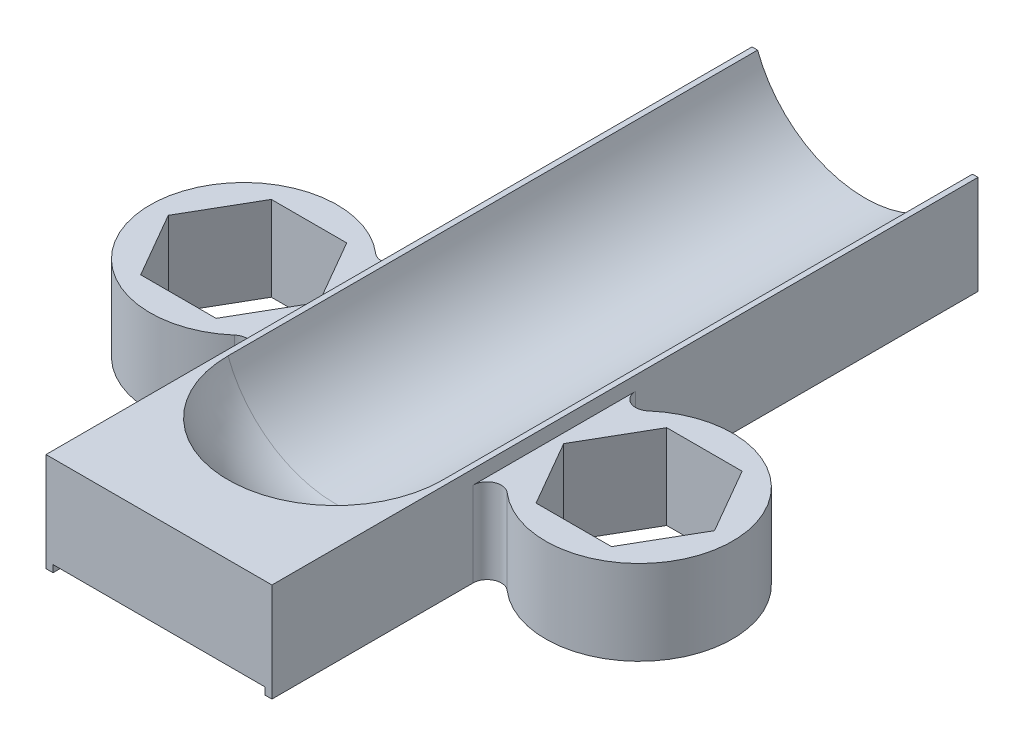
ISO-10303-21;
HEADER;
FILE_DESCRIPTION(('STEP AP214'),'2;1');
FILE_NAME('part.step','',(''),(''),'','','');
FILE_SCHEMA(('AUTOMOTIVE_DESIGN { 1 0 10303 214 1 1 1 1 }'));
ENDSEC;
DATA;
#1=APPLICATION_CONTEXT('core data for automotive mechanical design processes');
#2=APPLICATION_PROTOCOL_DEFINITION('international standard','automotive_design',2000,#1);
#3=PRODUCT_CONTEXT('',#1,'mechanical');
#4=PRODUCT('Part','Part','',(#3));
#5=PRODUCT_RELATED_PRODUCT_CATEGORY('part','',(#4));
#6=PRODUCT_DEFINITION_FORMATION('','',#4);
#7=PRODUCT_DEFINITION_CONTEXT('part definition',#1,'design');
#8=PRODUCT_DEFINITION('design','',#6,#7);
#9=PRODUCT_DEFINITION_SHAPE('','',#8);
#10=(LENGTH_UNIT() NAMED_UNIT(*) SI_UNIT(.MILLI.,.METRE.));
#11=(NAMED_UNIT(*) PLANE_ANGLE_UNIT() SI_UNIT($,.RADIAN.));
#12=(NAMED_UNIT(*) SI_UNIT($,.STERADIAN.) SOLID_ANGLE_UNIT());
#13=UNCERTAINTY_MEASURE_WITH_UNIT(LENGTH_MEASURE(1.E-05),#10,'distance_accuracy_value','');
#14=(GEOMETRIC_REPRESENTATION_CONTEXT(3) GLOBAL_UNCERTAINTY_ASSIGNED_CONTEXT((#13)) GLOBAL_UNIT_ASSIGNED_CONTEXT((#10,
#11,#12)) REPRESENTATION_CONTEXT('',''));
#15=CARTESIAN_POINT('',(0.,0.,0.));
#16=DIRECTION('',(0.,0.,1.));
#17=DIRECTION('',(1.,0.,0.));
#18=AXIS2_PLACEMENT_3D('',#15,#16,#17);
#19=CARTESIAN_POINT('',(0.,13.97,0.));
#20=DIRECTION('',(0.,1.,0.));
#21=DIRECTION('',(0.,0.,1.));
#22=AXIS2_PLACEMENT_3D('',#19,#20,#21);
#23=PLANE('',#22);
#24=DIRECTION('',(-0.5,0.,0.866025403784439));
#25=VECTOR('',#24,1.);
#26=CARTESIAN_POINT('',(27.6777254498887,13.97,-75.8825));
#27=LINE('',#26,#25);
#28=CARTESIAN_POINT('',(24.9280947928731,13.9700000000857,-71.12));
#29=VERTEX_POINT('',#28);
#30=CARTESIAN_POINT('',(24.1948599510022,13.9700000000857,-69.85));
#31=VERTEX_POINT('',#30);
#32=EDGE_CURVE('E120',#29,#31,#27,.T.);
#33=ORIENTED_EDGE('',*,*,#32,.F.);
#34=DIRECTION('',(-1.,0.,0.));
#35=VECTOR('',#34,1.);
#36=CARTESIAN_POINT('',(0.,13.9699999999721,-71.12));
#37=LINE('',#36,#35);
#38=CARTESIAN_POINT('',(19.05,13.9699999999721,-71.12));
#39=VERTEX_POINT('',#38);
#40=EDGE_CURVE('E70',#29,#39,#37,.T.);
#41=ORIENTED_EDGE('',*,*,#40,.T.);
#42=DIRECTION('',(0.,0.,1.));
#43=VECTOR('',#42,1.);
#44=CARTESIAN_POINT('',(19.05,13.97,0.));
#45=LINE('',#44,#43);
#46=CARTESIAN_POINT('',(19.05,13.9699999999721,-69.85));
#47=VERTEX_POINT('',#46);
#48=EDGE_CURVE('E12',#39,#47,#45,.T.);
#49=ORIENTED_EDGE('',*,*,#48,.T.);
#50=DIRECTION('',(-1.,0.,0.));
#51=VECTOR('',#50,1.);
#52=CARTESIAN_POINT('',(0.,13.9699999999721,-69.85));
#53=LINE('',#52,#51);
#54=EDGE_CURVE('E156',#31,#47,#53,.T.);
#55=ORIENTED_EDGE('',*,*,#54,.F.);
#56=EDGE_LOOP('',(#33,#41,#49,#55));
#57=FACE_BOUND('',#56,.T.);
#58=ADVANCED_FACE('F46',(#57),#23,.T.);
#59=CARTESIAN_POINT('',(19.05,17.78,0.));
#60=DIRECTION('',(1.,0.,0.));
#61=DIRECTION('',(0.,0.,-1.));
#62=AXIS2_PLACEMENT_3D('',#59,#60,#61);
#63=PLANE('',#62);
#64=ORIENTED_EDGE('',*,*,#48,.F.);
#65=DIRECTION('',(0.,1.,0.));
#66=VECTOR('',#65,1.);
#67=CARTESIAN_POINT('',(19.05,500000.,-71.12));
#68=LINE('',#67,#66);
#69=CARTESIAN_POINT('',(19.05,14.2006796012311,-71.12));
#70=VERTEX_POINT('',#69);
#71=EDGE_CURVE('E145',#39,#70,#68,.T.);
#72=ORIENTED_EDGE('',*,*,#71,.T.);
#73=DIRECTION('',(0.,0.,-1.));
#74=VECTOR('',#73,1.);
#75=CARTESIAN_POINT('',(19.05,14.2006796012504,0.));
#76=LINE('',#75,#74);
#77=CARTESIAN_POINT('',(19.05,14.2006796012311,-69.85));
#78=VERTEX_POINT('',#77);
#79=EDGE_CURVE('E55',#70,#78,#76,.F.);
#80=ORIENTED_EDGE('',*,*,#79,.T.);
#81=DIRECTION('',(0.,1.,0.));
#82=VECTOR('',#81,1.);
#83=CARTESIAN_POINT('',(19.05,500000.,-69.85));
#84=LINE('',#83,#82);
#85=EDGE_CURVE('E169',#47,#78,#84,.T.);
#86=ORIENTED_EDGE('',*,*,#85,.F.);
#87=EDGE_LOOP('',(#64,#72,#80,#86));
#88=FACE_BOUND('',#87,.T.);
#89=ADVANCED_FACE('F188',(#88),#63,.T.);
#90=CARTESIAN_POINT('',(0.,25.019,0.));
#91=DIRECTION('',(0.,0.,-1.));
#92=DIRECTION('',(-1.,0.,0.));
#93=AXIS2_PLACEMENT_3D('',#90,#91,#92);
#94=CYLINDRICAL_SURFACE('',#93,21.9075);
#95=ORIENTED_EDGE('',*,*,#79,.F.);
#96=CARTESIAN_POINT('',(0.,25.019,-71.12));
#97=DIRECTION('',(0.,0.,1.));
#98=DIRECTION('',(1.,0.,0.));
#99=AXIS2_PLACEMENT_3D('',#96,#97,#98);
#100=CIRCLE('',#99,21.9075);
#101=CARTESIAN_POINT('',(-19.05,14.2006796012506,-71.12));
#102=VERTEX_POINT('',#101);
#103=EDGE_CURVE('E147',#70,#102,#100,.F.);
#104=ORIENTED_EDGE('',*,*,#103,.T.);
#105=DIRECTION('',(0.,0.,-1.));
#106=VECTOR('',#105,1.);
#107=CARTESIAN_POINT('',(-19.05,14.2006796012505,0.));
#108=LINE('',#107,#106);
#109=CARTESIAN_POINT('',(-19.05,14.2006796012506,-69.85));
#110=VERTEX_POINT('',#109);
#111=EDGE_CURVE('E161',#110,#102,#108,.T.);
#112=ORIENTED_EDGE('',*,*,#111,.F.);
#113=CARTESIAN_POINT('',(0.,25.019,-69.85));
#114=DIRECTION('',(0.,0.,1.));
#115=DIRECTION('',(1.,0.,0.));
#116=AXIS2_PLACEMENT_3D('',#113,#114,#115);
#117=CIRCLE('',#116,21.9075);
#118=EDGE_CURVE('E171',#78,#110,#117,.F.);
#119=ORIENTED_EDGE('',*,*,#118,.F.);
#120=EDGE_LOOP('',(#95,#104,#112,#119));
#121=FACE_BOUND('',#120,.T.);
#122=ADVANCED_FACE('F195',(#121),#94,.F.);
#123=CARTESIAN_POINT('',(-19.05,17.78,0.));
#124=DIRECTION('',(1.,0.,0.));
#125=DIRECTION('',(0.,0.,-1.));
#126=AXIS2_PLACEMENT_3D('',#123,#124,#125);
#127=PLANE('',#126);
#128=DIRECTION('',(0.,1.,0.));
#129=VECTOR('',#128,1.);
#130=CARTESIAN_POINT('',(-19.05,500000.,-69.85));
#131=LINE('',#130,#129);
#132=CARTESIAN_POINT('',(-19.05,13.9699999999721,-69.85));
#133=VERTEX_POINT('',#132);
#134=EDGE_CURVE('E154',#133,#110,#131,.T.);
#135=ORIENTED_EDGE('',*,*,#134,.T.);
#136=ORIENTED_EDGE('',*,*,#111,.T.);
#137=DIRECTION('',(0.,1.,0.));
#138=VECTOR('',#137,1.);
#139=CARTESIAN_POINT('',(-19.05,500000.,-71.12));
#140=LINE('',#139,#138);
#141=CARTESIAN_POINT('',(-19.05,13.9699999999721,-71.12));
#142=VERTEX_POINT('',#141);
#143=EDGE_CURVE('E150',#142,#102,#140,.T.);
#144=ORIENTED_EDGE('',*,*,#143,.F.);
#145=DIRECTION('',(0.,0.,-1.));
#146=VECTOR('',#145,1.);
#147=CARTESIAN_POINT('',(-19.05,13.97,0.));
#148=LINE('',#147,#146);
#149=EDGE_CURVE('E164',#133,#142,#148,.T.);
#150=ORIENTED_EDGE('',*,*,#149,.F.);
#151=EDGE_LOOP('',(#135,#136,#144,#150));
#152=FACE_BOUND('',#151,.T.);
#153=ADVANCED_FACE('F175',(#152),#127,.F.);
#154=CARTESIAN_POINT('',(0.,13.97,0.));
#155=DIRECTION('',(0.,1.,0.));
#156=DIRECTION('',(0.,0.,1.));
#157=AXIS2_PLACEMENT_3D('',#154,#155,#156);
#158=PLANE('',#157);
#159=ORIENTED_EDGE('',*,*,#149,.T.);
#160=DIRECTION('',(-1.,0.,0.));
#161=VECTOR('',#160,1.);
#162=CARTESIAN_POINT('',(0.,13.9699999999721,-71.12));
#163=LINE('',#162,#161);
#164=CARTESIAN_POINT('',(-24.9280947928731,13.9700000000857,-71.12));
#165=VERTEX_POINT('',#164);
#166=EDGE_CURVE('E149',#142,#165,#163,.T.);
#167=ORIENTED_EDGE('',*,*,#166,.T.);
#168=DIRECTION('',(-0.500000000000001,0.,-0.866025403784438));
#169=VECTOR('',#168,1.);
#170=CARTESIAN_POINT('',(12.0997922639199,13.9699999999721,-6.98581832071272));
#171=LINE('',#170,#169);
#172=CARTESIAN_POINT('',(-24.1948599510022,13.9700000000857,-69.85));
#173=VERTEX_POINT('',#172);
#174=EDGE_CURVE('E63',#173,#165,#171,.T.);
#175=ORIENTED_EDGE('',*,*,#174,.F.);
#176=DIRECTION('',(-1.,0.,0.));
#177=VECTOR('',#176,1.);
#178=CARTESIAN_POINT('',(0.,13.9699999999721,-69.85));
#179=LINE('',#178,#177);
#180=EDGE_CURVE('E50',#133,#173,#179,.T.);
#181=ORIENTED_EDGE('',*,*,#180,.F.);
#182=EDGE_LOOP('',(#159,#167,#175,#181));
#183=FACE_BOUND('',#182,.T.);
#184=ADVANCED_FACE('F48',(#183),#158,.T.);
#185=CARTESIAN_POINT('',(-12.0997922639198,500000.,-6.98581832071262));
#186=DIRECTION('',(0.866025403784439,0.,0.499999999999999));
#187=DIRECTION('',(0.499999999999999,0.,-0.866025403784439));
#188=AXIS2_PLACEMENT_3D('',#185,#186,#187);
#189=PLANE('',#188);
#190=DIRECTION('',(0.,-1.,0.));
#191=VECTOR('',#190,1.);
#192=CARTESIAN_POINT('',(24.9280947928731,500000.,-71.12));
#193=LINE('',#192,#191);
#194=CARTESIAN_POINT('',(24.9280947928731,0.,-71.12));
#195=VERTEX_POINT('',#194);
#196=EDGE_CURVE('E142',#29,#195,#193,.T.);
#197=ORIENTED_EDGE('',*,*,#196,.F.);
#198=ORIENTED_EDGE('',*,*,#32,.T.);
#199=DIRECTION('',(0.,-1.,0.));
#200=VECTOR('',#199,1.);
#201=CARTESIAN_POINT('',(24.1948599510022,500000.,-69.85));
#202=LINE('',#201,#200);
#203=CARTESIAN_POINT('',(24.1948599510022,0.,-69.85));
#204=VERTEX_POINT('',#203);
#205=EDGE_CURVE('E140',#31,#204,#202,.T.);
#206=ORIENTED_EDGE('',*,*,#205,.T.);
#207=DIRECTION('',(-0.499999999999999,0.,0.866025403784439));
#208=VECTOR('',#207,1.);
#209=CARTESIAN_POINT('',(-12.0997922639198,0.,-6.98581832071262));
#210=LINE('',#209,#208);
#211=EDGE_CURVE('E135',#195,#204,#210,.T.);
#212=ORIENTED_EDGE('',*,*,#211,.F.);
#213=EDGE_LOOP('',(#197,#198,#206,#212));
#214=FACE_BOUND('',#213,.T.);
#215=ADVANCED_FACE('F184',(#214),#189,.T.);
#216=CARTESIAN_POINT('',(0.,500000.,-71.12));
#217=DIRECTION('',(0.,0.,1.));
#218=DIRECTION('',(1.,0.,0.));
#219=AXIS2_PLACEMENT_3D('',#216,#217,#218);
#220=PLANE('',#219);
#221=ORIENTED_EDGE('',*,*,#166,.F.);
#222=ORIENTED_EDGE('',*,*,#143,.T.);
#223=ORIENTED_EDGE('',*,*,#103,.F.);
#224=ORIENTED_EDGE('',*,*,#71,.F.);
#225=ORIENTED_EDGE('',*,*,#40,.F.);
#226=ORIENTED_EDGE('',*,*,#196,.T.);
#227=DIRECTION('',(-1.,0.,0.));
#228=VECTOR('',#227,1.);
#229=CARTESIAN_POINT('',(0.,0.,-71.12));
#230=LINE('',#229,#228);
#231=CARTESIAN_POINT('',(-24.9280947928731,0.,-71.12));
#232=VERTEX_POINT('',#231);
#233=EDGE_CURVE('E130',#195,#232,#230,.T.);
#234=ORIENTED_EDGE('',*,*,#233,.T.);
#235=DIRECTION('',(0.,-1.,0.));
#236=VECTOR('',#235,1.);
#237=CARTESIAN_POINT('',(-24.9280947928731,500000.,-71.12));
#238=LINE('',#237,#236);
#239=EDGE_CURVE('E121',#165,#232,#238,.T.);
#240=ORIENTED_EDGE('',*,*,#239,.F.);
#241=EDGE_LOOP('',(#221,#222,#223,#224,#225,#226,#234,#240));
#242=FACE_BOUND('',#241,.T.);
#243=ADVANCED_FACE('F181',(#242),#220,.F.);
#244=CARTESIAN_POINT('',(0.,500000.,-69.85));
#245=DIRECTION('',(0.,0.,1.));
#246=DIRECTION('',(1.,0.,0.));
#247=AXIS2_PLACEMENT_3D('',#244,#245,#246);
#248=PLANE('',#247);
#249=ORIENTED_EDGE('',*,*,#134,.F.);
#250=ORIENTED_EDGE('',*,*,#180,.T.);
#251=DIRECTION('',(0.,-1.,0.));
#252=VECTOR('',#251,1.);
#253=CARTESIAN_POINT('',(-24.1948599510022,500000.,-69.85));
#254=LINE('',#253,#252);
#255=CARTESIAN_POINT('',(-24.1948599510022,0.,-69.85));
#256=VERTEX_POINT('',#255);
#257=EDGE_CURVE('E113',#173,#256,#254,.T.);
#258=ORIENTED_EDGE('',*,*,#257,.T.);
#259=DIRECTION('',(-1.,0.,0.));
#260=VECTOR('',#259,1.);
#261=CARTESIAN_POINT('',(0.,0.,-69.85));
#262=LINE('',#261,#260);
#263=EDGE_CURVE('E118',#204,#256,#262,.T.);
#264=ORIENTED_EDGE('',*,*,#263,.F.);
#265=ORIENTED_EDGE('',*,*,#205,.F.);
#266=ORIENTED_EDGE('',*,*,#54,.T.);
#267=ORIENTED_EDGE('',*,*,#85,.T.);
#268=ORIENTED_EDGE('',*,*,#118,.T.);
#269=EDGE_LOOP('',(#249,#250,#258,#264,#265,#266,#267,#268));
#270=FACE_BOUND('',#269,.T.);
#271=ADVANCED_FACE('F115',(#270),#248,.T.);
#272=CARTESIAN_POINT('',(0.,0.,0.));
#273=DIRECTION('',(0.,-1.,0.));
#274=DIRECTION('',(0.,0.,-1.));
#275=AXIS2_PLACEMENT_3D('',#272,#273,#274);
#276=PLANE('',#275);
#277=ORIENTED_EDGE('',*,*,#263,.T.);
#278=DIRECTION('',(-0.500000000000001,0.,-0.866025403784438));
#279=VECTOR('',#278,1.);
#280=CARTESIAN_POINT('',(12.0997922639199,0.,-6.98581832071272));
#281=LINE('',#280,#279);
#282=EDGE_CURVE('E124',#256,#232,#281,.T.);
#283=ORIENTED_EDGE('',*,*,#282,.T.);
#284=ORIENTED_EDGE('',*,*,#233,.F.);
#285=ORIENTED_EDGE('',*,*,#211,.T.);
#286=EDGE_LOOP('',(#277,#283,#284,#285));
#287=FACE_BOUND('',#286,.T.);
#288=ADVANCED_FACE('F133',(#287),#276,.T.);
#289=CARTESIAN_POINT('',(12.0997922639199,500000.,-6.98581832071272));
#290=DIRECTION('',(-0.866025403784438,0.,0.500000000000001));
#291=DIRECTION('',(0.500000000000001,0.,0.866025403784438));
#292=AXIS2_PLACEMENT_3D('',#289,#290,#291);
#293=PLANE('',#292);
#294=ORIENTED_EDGE('',*,*,#257,.F.);
#295=ORIENTED_EDGE('',*,*,#174,.T.);
#296=ORIENTED_EDGE('',*,*,#239,.T.);
#297=ORIENTED_EDGE('',*,*,#282,.F.);
#298=EDGE_LOOP('',(#294,#295,#296,#297));
#299=FACE_BOUND('',#298,.T.);
#300=ADVANCED_FACE('F125',(#299),#293,.T.);
#301=CLOSED_SHELL('',(#58,#89,#122,#153,#184,#215,#243,#271,#288,#300));
#302=MANIFOLD_SOLID_BREP('B2',#301);
#303=CARTESIAN_POINT('',(0.,13.97,0.));
#304=DIRECTION('',(0.,1.,0.));
#305=DIRECTION('',(0.,0.,1.));
#306=AXIS2_PLACEMENT_3D('',#303,#304,#305);
#307=PLANE('',#306);
#308=DIRECTION('',(0.499999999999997,0.,0.86602540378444));
#309=VECTOR('',#308,1.);
#310=CARTESIAN_POINT('',(20.8953031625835,13.97,-62.865));
#311=LINE('',#310,#309);
#312=CARTESIAN_POINT('',(24.1948599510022,13.9700000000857,-57.15));
#313=VERTEX_POINT('',#312);
#314=CARTESIAN_POINT('',(24.928094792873,13.9700000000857,-55.88));
#315=VERTEX_POINT('',#314);
#316=EDGE_CURVE('E358',#313,#315,#311,.T.);
#317=ORIENTED_EDGE('',*,*,#316,.F.);
#318=DIRECTION('',(-1.,0.,0.));
#319=VECTOR('',#318,1.);
#320=CARTESIAN_POINT('',(0.,13.9699999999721,-57.15));
#321=LINE('',#320,#319);
#322=CARTESIAN_POINT('',(19.05,13.9699999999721,-57.15));
#323=VERTEX_POINT('',#322);
#324=EDGE_CURVE('E308',#313,#323,#321,.T.);
#325=ORIENTED_EDGE('',*,*,#324,.T.);
#326=DIRECTION('',(0.,0.,1.));
#327=VECTOR('',#326,1.);
#328=CARTESIAN_POINT('',(19.05,13.97,0.));
#329=LINE('',#328,#327);
#330=CARTESIAN_POINT('',(19.05,13.9699999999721,-55.88));
#331=VERTEX_POINT('',#330);
#332=EDGE_CURVE('E44',#323,#331,#329,.T.);
#333=ORIENTED_EDGE('',*,*,#332,.T.);
#334=DIRECTION('',(-1.,0.,0.));
#335=VECTOR('',#334,1.);
#336=CARTESIAN_POINT('',(0.,13.9699999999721,-55.88));
#337=LINE('',#336,#335);
#338=EDGE_CURVE('E394',#315,#331,#337,.T.);
#339=ORIENTED_EDGE('',*,*,#338,.F.);
#340=EDGE_LOOP('',(#317,#325,#333,#339));
#341=FACE_BOUND('',#340,.T.);
#342=ADVANCED_FACE('F284',(#341),#307,.T.);
#343=CARTESIAN_POINT('',(19.05,17.78,0.));
#344=DIRECTION('',(1.,0.,0.));
#345=DIRECTION('',(0.,0.,-1.));
#346=AXIS2_PLACEMENT_3D('',#343,#344,#345);
#347=PLANE('',#346);
#348=ORIENTED_EDGE('',*,*,#332,.F.);
#349=DIRECTION('',(0.,1.,0.));
#350=VECTOR('',#349,1.);
#351=CARTESIAN_POINT('',(19.05,500000.,-57.15));
#352=LINE('',#351,#350);
#353=CARTESIAN_POINT('',(19.05,14.2006796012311,-57.15));
#354=VERTEX_POINT('',#353);
#355=EDGE_CURVE('E383',#323,#354,#352,.T.);
#356=ORIENTED_EDGE('',*,*,#355,.T.);
#357=DIRECTION('',(0.,0.,-1.));
#358=VECTOR('',#357,1.);
#359=CARTESIAN_POINT('',(19.05,14.2006796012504,0.));
#360=LINE('',#359,#358);
#361=CARTESIAN_POINT('',(19.05,14.2006796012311,-55.88));
#362=VERTEX_POINT('',#361);
#363=EDGE_CURVE('E293',#354,#362,#360,.F.);
#364=ORIENTED_EDGE('',*,*,#363,.T.);
#365=DIRECTION('',(0.,1.,0.));
#366=VECTOR('',#365,1.);
#367=CARTESIAN_POINT('',(19.05,500000.,-55.88));
#368=LINE('',#367,#366);
#369=EDGE_CURVE('E407',#331,#362,#368,.T.);
#370=ORIENTED_EDGE('',*,*,#369,.F.);
#371=EDGE_LOOP('',(#348,#356,#364,#370));
#372=FACE_BOUND('',#371,.T.);
#373=ADVANCED_FACE('F426',(#372),#347,.T.);
#374=CARTESIAN_POINT('',(0.,25.019,0.));
#375=DIRECTION('',(0.,0.,-1.));
#376=DIRECTION('',(-1.,0.,0.));
#377=AXIS2_PLACEMENT_3D('',#374,#375,#376);
#378=CYLINDRICAL_SURFACE('',#377,21.9075);
#379=ORIENTED_EDGE('',*,*,#363,.F.);
#380=CARTESIAN_POINT('',(0.,25.019,-57.15));
#381=DIRECTION('',(0.,0.,1.));
#382=DIRECTION('',(1.,0.,0.));
#383=AXIS2_PLACEMENT_3D('',#380,#381,#382);
#384=CIRCLE('',#383,21.9075);
#385=CARTESIAN_POINT('',(-19.05,14.2006796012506,-57.15));
#386=VERTEX_POINT('',#385);
#387=EDGE_CURVE('E385',#354,#386,#384,.F.);
#388=ORIENTED_EDGE('',*,*,#387,.T.);
#389=DIRECTION('',(0.,0.,-1.));
#390=VECTOR('',#389,1.);
#391=CARTESIAN_POINT('',(-19.05,14.2006796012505,0.));
#392=LINE('',#391,#390);
#393=CARTESIAN_POINT('',(-19.05,14.2006796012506,-55.88));
#394=VERTEX_POINT('',#393);
#395=EDGE_CURVE('E399',#394,#386,#392,.T.);
#396=ORIENTED_EDGE('',*,*,#395,.F.);
#397=CARTESIAN_POINT('',(0.,25.019,-55.88));
#398=DIRECTION('',(0.,0.,1.));
#399=DIRECTION('',(1.,0.,0.));
#400=AXIS2_PLACEMENT_3D('',#397,#398,#399);
#401=CIRCLE('',#400,21.9075);
#402=EDGE_CURVE('E409',#362,#394,#401,.F.);
#403=ORIENTED_EDGE('',*,*,#402,.F.);
#404=EDGE_LOOP('',(#379,#388,#396,#403));
#405=FACE_BOUND('',#404,.T.);
#406=ADVANCED_FACE('F433',(#405),#378,.F.);
#407=CARTESIAN_POINT('',(-19.05,17.78,0.));
#408=DIRECTION('',(1.,0.,0.));
#409=DIRECTION('',(0.,0.,-1.));
#410=AXIS2_PLACEMENT_3D('',#407,#408,#409);
#411=PLANE('',#410);
#412=DIRECTION('',(0.,1.,0.));
#413=VECTOR('',#412,1.);
#414=CARTESIAN_POINT('',(-19.05,500000.,-55.88));
#415=LINE('',#414,#413);
#416=CARTESIAN_POINT('',(-19.05,13.9699999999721,-55.88));
#417=VERTEX_POINT('',#416);
#418=EDGE_CURVE('E392',#417,#394,#415,.T.);
#419=ORIENTED_EDGE('',*,*,#418,.T.);
#420=ORIENTED_EDGE('',*,*,#395,.T.);
#421=DIRECTION('',(0.,1.,0.));
#422=VECTOR('',#421,1.);
#423=CARTESIAN_POINT('',(-19.05,500000.,-57.15));
#424=LINE('',#423,#422);
#425=CARTESIAN_POINT('',(-19.05,13.9699999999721,-57.15));
#426=VERTEX_POINT('',#425);
#427=EDGE_CURVE('E388',#426,#386,#424,.T.);
#428=ORIENTED_EDGE('',*,*,#427,.F.);
#429=DIRECTION('',(0.,0.,-1.));
#430=VECTOR('',#429,1.);
#431=CARTESIAN_POINT('',(-19.05,13.97,0.));
#432=LINE('',#431,#430);
#433=EDGE_CURVE('E402',#417,#426,#432,.T.);
#434=ORIENTED_EDGE('',*,*,#433,.F.);
#435=EDGE_LOOP('',(#419,#420,#428,#434));
#436=FACE_BOUND('',#435,.T.);
#437=ADVANCED_FACE('F413',(#436),#411,.F.);
#438=CARTESIAN_POINT('',(0.,13.97,0.));
#439=DIRECTION('',(0.,1.,0.));
#440=DIRECTION('',(0.,0.,1.));
#441=AXIS2_PLACEMENT_3D('',#438,#439,#440);
#442=PLANE('',#441);
#443=ORIENTED_EDGE('',*,*,#433,.T.);
#444=DIRECTION('',(-1.,0.,0.));
#445=VECTOR('',#444,1.);
#446=CARTESIAN_POINT('',(0.,13.9699999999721,-57.15));
#447=LINE('',#446,#445);
#448=CARTESIAN_POINT('',(-24.1948599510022,13.9700000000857,-57.15));
#449=VERTEX_POINT('',#448);
#450=EDGE_CURVE('E387',#426,#449,#447,.T.);
#451=ORIENTED_EDGE('',*,*,#450,.T.);
#452=DIRECTION('',(0.499999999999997,0.,-0.86602540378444));
#453=VECTOR('',#452,1.);
#454=CARTESIAN_POINT('',(-42.892820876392,13.9699999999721,-24.7641816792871));
#455=LINE('',#454,#453);
#456=CARTESIAN_POINT('',(-24.928094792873,13.9700000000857,-55.88));
#457=VERTEX_POINT('',#456);
#458=EDGE_CURVE('E301',#457,#449,#455,.T.);
#459=ORIENTED_EDGE('',*,*,#458,.F.);
#460=DIRECTION('',(-1.,0.,0.));
#461=VECTOR('',#460,1.);
#462=CARTESIAN_POINT('',(0.,13.9699999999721,-55.88));
#463=LINE('',#462,#461);
#464=EDGE_CURVE('E288',#417,#457,#463,.T.);
#465=ORIENTED_EDGE('',*,*,#464,.F.);
#466=EDGE_LOOP('',(#443,#451,#459,#465));
#467=FACE_BOUND('',#466,.T.);
#468=ADVANCED_FACE('F286',(#467),#442,.T.);
#469=CARTESIAN_POINT('',(42.892820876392,500000.,-24.7641816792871));
#470=DIRECTION('',(0.86602540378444,0.,-0.499999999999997));
#471=DIRECTION('',(-0.499999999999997,0.,-0.86602540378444));
#472=AXIS2_PLACEMENT_3D('',#469,#470,#471);
#473=PLANE('',#472);
#474=DIRECTION('',(0.,-1.,0.));
#475=VECTOR('',#474,1.);
#476=CARTESIAN_POINT('',(24.1948599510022,500000.,-57.15));
#477=LINE('',#476,#475);
#478=CARTESIAN_POINT('',(24.1948599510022,0.,-57.15));
#479=VERTEX_POINT('',#478);
#480=EDGE_CURVE('E380',#313,#479,#477,.T.);
#481=ORIENTED_EDGE('',*,*,#480,.F.);
#482=ORIENTED_EDGE('',*,*,#316,.T.);
#483=DIRECTION('',(0.,-1.,0.));
#484=VECTOR('',#483,1.);
#485=CARTESIAN_POINT('',(24.928094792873,500000.,-55.88));
#486=LINE('',#485,#484);
#487=CARTESIAN_POINT('',(24.928094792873,0.,-55.88));
#488=VERTEX_POINT('',#487);
#489=EDGE_CURVE('E378',#315,#488,#486,.T.);
#490=ORIENTED_EDGE('',*,*,#489,.T.);
#491=DIRECTION('',(0.499999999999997,0.,0.86602540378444));
#492=VECTOR('',#491,1.);
#493=CARTESIAN_POINT('',(42.892820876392,0.,-24.7641816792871));
#494=LINE('',#493,#492);
#495=EDGE_CURVE('E373',#479,#488,#494,.T.);
#496=ORIENTED_EDGE('',*,*,#495,.F.);
#497=EDGE_LOOP('',(#481,#482,#490,#496));
#498=FACE_BOUND('',#497,.T.);
#499=ADVANCED_FACE('F422',(#498),#473,.T.);
#500=CARTESIAN_POINT('',(0.,500000.,-57.15));
#501=DIRECTION('',(0.,0.,1.));
#502=DIRECTION('',(1.,0.,0.));
#503=AXIS2_PLACEMENT_3D('',#500,#501,#502);
#504=PLANE('',#503);
#505=ORIENTED_EDGE('',*,*,#450,.F.);
#506=ORIENTED_EDGE('',*,*,#427,.T.);
#507=ORIENTED_EDGE('',*,*,#387,.F.);
#508=ORIENTED_EDGE('',*,*,#355,.F.);
#509=ORIENTED_EDGE('',*,*,#324,.F.);
#510=ORIENTED_EDGE('',*,*,#480,.T.);
#511=DIRECTION('',(-1.,0.,0.));
#512=VECTOR('',#511,1.);
#513=CARTESIAN_POINT('',(0.,0.,-57.15));
#514=LINE('',#513,#512);
#515=CARTESIAN_POINT('',(-24.1948599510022,0.,-57.15));
#516=VERTEX_POINT('',#515);
#517=EDGE_CURVE('E368',#479,#516,#514,.T.);
#518=ORIENTED_EDGE('',*,*,#517,.T.);
#519=DIRECTION('',(0.,-1.,0.));
#520=VECTOR('',#519,1.);
#521=CARTESIAN_POINT('',(-24.1948599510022,500000.,-57.15));
#522=LINE('',#521,#520);
#523=EDGE_CURVE('E359',#449,#516,#522,.T.);
#524=ORIENTED_EDGE('',*,*,#523,.F.);
#525=EDGE_LOOP('',(#505,#506,#507,#508,#509,#510,#518,#524));
#526=FACE_BOUND('',#525,.T.);
#527=ADVANCED_FACE('F419',(#526),#504,.F.);
#528=CARTESIAN_POINT('',(0.,500000.,-55.88));
#529=DIRECTION('',(0.,0.,1.));
#530=DIRECTION('',(1.,0.,0.));
#531=AXIS2_PLACEMENT_3D('',#528,#529,#530);
#532=PLANE('',#531);
#533=ORIENTED_EDGE('',*,*,#418,.F.);
#534=ORIENTED_EDGE('',*,*,#464,.T.);
#535=DIRECTION('',(0.,-1.,0.));
#536=VECTOR('',#535,1.);
#537=CARTESIAN_POINT('',(-24.928094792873,500000.,-55.88));
#538=LINE('',#537,#536);
#539=CARTESIAN_POINT('',(-24.928094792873,0.,-55.88));
#540=VERTEX_POINT('',#539);
#541=EDGE_CURVE('E351',#457,#540,#538,.T.);
#542=ORIENTED_EDGE('',*,*,#541,.T.);
#543=DIRECTION('',(-1.,0.,0.));
#544=VECTOR('',#543,1.);
#545=CARTESIAN_POINT('',(0.,0.,-55.88));
#546=LINE('',#545,#544);
#547=EDGE_CURVE('E356',#488,#540,#546,.T.);
#548=ORIENTED_EDGE('',*,*,#547,.F.);
#549=ORIENTED_EDGE('',*,*,#489,.F.);
#550=ORIENTED_EDGE('',*,*,#338,.T.);
#551=ORIENTED_EDGE('',*,*,#369,.T.);
#552=ORIENTED_EDGE('',*,*,#402,.T.);
#553=EDGE_LOOP('',(#533,#534,#542,#548,#549,#550,#551,#552));
#554=FACE_BOUND('',#553,.T.);
#555=ADVANCED_FACE('F353',(#554),#532,.T.);
#556=CARTESIAN_POINT('',(0.,0.,0.));
#557=DIRECTION('',(0.,-1.,0.));
#558=DIRECTION('',(0.,0.,-1.));
#559=AXIS2_PLACEMENT_3D('',#556,#557,#558);
#560=PLANE('',#559);
#561=ORIENTED_EDGE('',*,*,#547,.T.);
#562=DIRECTION('',(0.499999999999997,0.,-0.86602540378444));
#563=VECTOR('',#562,1.);
#564=CARTESIAN_POINT('',(-42.892820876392,0.,-24.7641816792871));
#565=LINE('',#564,#563);
#566=EDGE_CURVE('E362',#540,#516,#565,.T.);
#567=ORIENTED_EDGE('',*,*,#566,.T.);
#568=ORIENTED_EDGE('',*,*,#517,.F.);
#569=ORIENTED_EDGE('',*,*,#495,.T.);
#570=EDGE_LOOP('',(#561,#567,#568,#569));
#571=FACE_BOUND('',#570,.T.);
#572=ADVANCED_FACE('F371',(#571),#560,.T.);
#573=CARTESIAN_POINT('',(-42.892820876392,500000.,-24.7641816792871));
#574=DIRECTION('',(-0.86602540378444,0.,-0.499999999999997));
#575=DIRECTION('',(-0.499999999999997,0.,0.86602540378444));
#576=AXIS2_PLACEMENT_3D('',#573,#574,#575);
#577=PLANE('',#576);
#578=ORIENTED_EDGE('',*,*,#541,.F.);
#579=ORIENTED_EDGE('',*,*,#458,.T.);
#580=ORIENTED_EDGE('',*,*,#523,.T.);
#581=ORIENTED_EDGE('',*,*,#566,.F.);
#582=EDGE_LOOP('',(#578,#579,#580,#581));
#583=FACE_BOUND('',#582,.T.);
#584=ADVANCED_FACE('F363',(#583),#577,.T.);
#585=CLOSED_SHELL('',(#342,#373,#406,#437,#468,#499,#527,#555,#572,#584));
#586=MANIFOLD_SOLID_BREP('B6',#585);
#587=CARTESIAN_POINT('',(0.,0.,0.));
#588=DIRECTION('',(0.,-1.,0.));
#589=DIRECTION('',(0.,0.,-1.));
#590=AXIS2_PLACEMENT_3D('',#587,#588,#589);
#591=PLANE('',#590);
#592=DIRECTION('',(0.500000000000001,0.,-0.866025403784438));
#593=VECTOR('',#592,1.);
#594=CARTESIAN_POINT('',(10.4471791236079,0.,6.03168167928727));
#595=LINE('',#594,#593);
#596=CARTESIAN_POINT('',(43.0756571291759,0.,-50.4825));
#597=VERTEX_POINT('',#596);
#598=CARTESIAN_POINT('',(50.5913142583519,0.,-63.5));
#599=VERTEX_POINT('',#598);
#600=EDGE_CURVE('E1248',#597,#599,#595,.T.);
#601=ORIENTED_EDGE('',*,*,#600,.F.);
#602=DIRECTION('',(1.,0.,0.));
#603=VECTOR('',#602,1.);
#604=CARTESIAN_POINT('',(0.,0.,-50.4825000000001));
#605=LINE('',#604,#603);
#606=CARTESIAN_POINT('',(28.044342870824,0.,-50.4825));
#607=VERTEX_POINT('',#606);
#608=EDGE_CURVE('E1252',#607,#597,#605,.T.);
#609=ORIENTED_EDGE('',*,*,#608,.F.);
#610=DIRECTION('',(0.499999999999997,0.,0.86602540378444));
#611=VECTOR('',#610,1.);
#612=CARTESIAN_POINT('',(42.892820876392,0.,-24.7641816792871));
#613=LINE('',#612,#611);
#614=CARTESIAN_POINT('',(20.5286857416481,0.,-63.5));
#615=VERTEX_POINT('',#614);
#616=EDGE_CURVE('E535',#615,#607,#613,.T.);
#617=ORIENTED_EDGE('',*,*,#616,.F.);
#618=DIRECTION('',(-0.5,0.,0.866025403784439));
#619=VECTOR('',#618,1.);
#620=CARTESIAN_POINT('',(-12.0997922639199,0.,-6.98581832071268));
#621=LINE('',#620,#619);
#622=CARTESIAN_POINT('',(28.0443428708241,0.,-76.5175));
#623=VERTEX_POINT('',#622);
#624=EDGE_CURVE('E1256',#623,#615,#621,.T.);
#625=ORIENTED_EDGE('',*,*,#624,.F.);
#626=DIRECTION('',(-1.,0.,0.));
#627=VECTOR('',#626,1.);
#628=CARTESIAN_POINT('',(1.5656554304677E-13,0.,-76.5175000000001));
#629=LINE('',#628,#627);
#630=CARTESIAN_POINT('',(43.075657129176,0.,-76.5175));
#631=VERTEX_POINT('',#630);
#632=EDGE_CURVE('E1259',#631,#623,#629,.T.);
#633=ORIENTED_EDGE('',*,*,#632,.F.);
#634=DIRECTION('',(-0.499999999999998,0.,-0.86602540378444));
#635=VECTOR('',#634,1.);
#636=CARTESIAN_POINT('',(65.4397922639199,0.,-37.7816816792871));
#637=LINE('',#636,#635);
#638=EDGE_CURVE('E1262',#599,#631,#637,.T.);
#639=ORIENTED_EDGE('',*,*,#638,.F.);
#640=EDGE_LOOP('',(#601,#609,#617,#625,#633,#639));
#641=FACE_BOUND('',#640,.T.);
#642=DIRECTION('',(0.500000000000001,0.,-0.866025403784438));
#643=VECTOR('',#642,1.);
#644=CARTESIAN_POINT('',(42.3424222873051,0.,-51.7525));
#645=LINE('',#644,#643);
#646=CARTESIAN_POINT('',(42.3424222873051,0.,-51.7525));
#647=VERTEX_POINT('',#646);
#648=CARTESIAN_POINT('',(49.1248445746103,0.,-63.5));
#649=VERTEX_POINT('',#648);
#650=EDGE_CURVE('E957',#647,#649,#645,.T.);
#651=ORIENTED_EDGE('',*,*,#650,.T.);
#652=DIRECTION('',(-0.499999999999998,0.,-0.86602540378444));
#653=VECTOR('',#652,1.);
#654=CARTESIAN_POINT('',(49.1248445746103,0.,-63.5));
#655=LINE('',#654,#653);
#656=CARTESIAN_POINT('',(42.3424222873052,0.,-75.2475));
#657=VERTEX_POINT('',#656);
#658=EDGE_CURVE('E942',#649,#657,#655,.T.);
#659=ORIENTED_EDGE('',*,*,#658,.T.);
#660=DIRECTION('',(-1.,0.,0.));
#661=VECTOR('',#660,1.);
#662=CARTESIAN_POINT('',(42.3424222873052,0.,-75.2475));
#663=LINE('',#662,#661);
#664=CARTESIAN_POINT('',(28.7775777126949,0.,-75.2475));
#665=VERTEX_POINT('',#664);
#666=EDGE_CURVE('E945',#657,#665,#663,.T.);
#667=ORIENTED_EDGE('',*,*,#666,.T.);
#668=DIRECTION('',(-0.5,0.,0.866025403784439));
#669=VECTOR('',#668,1.);
#670=CARTESIAN_POINT('',(28.7775777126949,0.,-75.2475));
#671=LINE('',#670,#669);
#672=CARTESIAN_POINT('',(21.9951554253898,0.,-63.5));
#673=VERTEX_POINT('',#672);
#674=EDGE_CURVE('E948',#665,#673,#671,.T.);
#675=ORIENTED_EDGE('',*,*,#674,.T.);
#676=DIRECTION('',(0.499999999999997,0.,0.86602540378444));
#677=VECTOR('',#676,1.);
#678=CARTESIAN_POINT('',(21.9951554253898,0.,-63.5));
#679=LINE('',#678,#677);
#680=CARTESIAN_POINT('',(28.7775777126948,0.,-51.7525));
#681=VERTEX_POINT('',#680);
#682=EDGE_CURVE('E951',#673,#681,#679,.T.);
#683=ORIENTED_EDGE('',*,*,#682,.T.);
#684=DIRECTION('',(1.,0.,0.));
#685=VECTOR('',#684,1.);
#686=CARTESIAN_POINT('',(28.7775777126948,0.,-51.7525));
#687=LINE('',#686,#685);
#688=EDGE_CURVE('E954',#681,#647,#687,.T.);
#689=ORIENTED_EDGE('',*,*,#688,.T.);
#690=EDGE_LOOP('',(#651,#659,#667,#675,#683,#689));
#691=FACE_BOUND('',#690,.T.);
#692=ADVANCED_FACE('F513',(#641,#691),#591,.T.);
#693=DIRECTION('',(-1.,0.,0.));
#694=VECTOR('',#693,1.);
#695=CARTESIAN_POINT('',(20.32,0.,-12.7));
#696=LINE('',#695,#694);
#697=CARTESIAN_POINT('',(-19.05,0.,-12.7));
#698=VERTEX_POINT('',#697);
#699=CARTESIAN_POINT('',(-20.32,0.,-12.7));
#700=VERTEX_POINT('',#699);
#701=EDGE_CURVE('E872',#698,#700,#696,.T.);
#702=ORIENTED_EDGE('',*,*,#701,.T.);
#703=DIRECTION('',(0.,0.,1.));
#704=VECTOR('',#703,1.);
#705=CARTESIAN_POINT('',(-20.32,0.,0.));
#706=LINE('',#705,#704);
#707=CARTESIAN_POINT('',(-20.32,0.,-48.8777547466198));
#708=VERTEX_POINT('',#707);
#709=EDGE_CURVE('E884',#708,#700,#706,.T.);
#710=ORIENTED_EDGE('',*,*,#709,.F.);
#711=CARTESIAN_POINT('',(-22.86,0.,-48.8777547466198));
#712=DIRECTION('',(0.,-1.,0.));
#713=DIRECTION('',(0.,0.,-1.));
#714=AXIS2_PLACEMENT_3D('',#711,#712,#713);
#715=CIRCLE('',#714,2.54);
#716=CARTESIAN_POINT('',(-24.5255737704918,0.,-50.7954262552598));
#717=VERTEX_POINT('',#716);
#718=EDGE_CURVE('E999',#708,#717,#715,.F.);
#719=ORIENTED_EDGE('',*,*,#718,.T.);
#720=CARTESIAN_POINT('',(-35.56,0.,-63.5));
#721=DIRECTION('',(0.,1.,0.));
#722=DIRECTION('',(0.,0.,1.));
#723=AXIS2_PLACEMENT_3D('',#720,#721,#722);
#724=CIRCLE('',#723,16.8275);
#725=CARTESIAN_POINT('',(-24.5255737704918,0.,-76.2045737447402));
#726=VERTEX_POINT('',#725);
#727=EDGE_CURVE('E1069',#726,#717,#724,.T.);
#728=ORIENTED_EDGE('',*,*,#727,.F.);
#729=CARTESIAN_POINT('',(-22.86,0.,-78.1222452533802));
#730=DIRECTION('',(0.,-1.,0.));
#731=DIRECTION('',(0.,0.,-1.));
#732=AXIS2_PLACEMENT_3D('',#729,#730,#731);
#733=CIRCLE('',#732,2.54);
#734=CARTESIAN_POINT('',(-20.32,0.,-78.1222452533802));
#735=VERTEX_POINT('',#734);
#736=EDGE_CURVE('E1001',#726,#735,#733,.F.);
#737=ORIENTED_EDGE('',*,*,#736,.T.);
#738=DIRECTION('',(0.,0.,-1.));
#739=VECTOR('',#738,1.);
#740=CARTESIAN_POINT('',(-20.32,0.,0.));
#741=LINE('',#740,#739);
#742=CARTESIAN_POINT('',(-20.32,0.,-139.7));
#743=VERTEX_POINT('',#742);
#744=EDGE_CURVE('E1072',#735,#743,#741,.T.);
#745=ORIENTED_EDGE('',*,*,#744,.T.);
#746=DIRECTION('',(-1.,0.,0.));
#747=VECTOR('',#746,1.);
#748=CARTESIAN_POINT('',(-53.975,0.,-139.7));
#749=LINE('',#748,#747);
#750=CARTESIAN_POINT('',(20.32,0.,-139.7));
#751=VERTEX_POINT('',#750);
#752=EDGE_CURVE('E974',#751,#743,#749,.T.);
#753=ORIENTED_EDGE('',*,*,#752,.F.);
#754=DIRECTION('',(0.,0.,1.));
#755=VECTOR('',#754,1.);
#756=CARTESIAN_POINT('',(20.32,0.,0.));
#757=LINE('',#756,#755);
#758=CARTESIAN_POINT('',(20.32,0.,-78.1222452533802));
#759=VERTEX_POINT('',#758);
#760=EDGE_CURVE('E878',#751,#759,#757,.T.);
#761=ORIENTED_EDGE('',*,*,#760,.T.);
#762=CARTESIAN_POINT('',(22.86,0.,-78.1222452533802));
#763=DIRECTION('',(0.,-1.,0.));
#764=DIRECTION('',(0.,0.,-1.));
#765=AXIS2_PLACEMENT_3D('',#762,#763,#764);
#766=CIRCLE('',#765,2.54);
#767=CARTESIAN_POINT('',(24.5255737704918,0.,-76.2045737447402));
#768=VERTEX_POINT('',#767);
#769=EDGE_CURVE('E1003',#759,#768,#766,.F.);
#770=ORIENTED_EDGE('',*,*,#769,.T.);
#771=CARTESIAN_POINT('',(35.56,0.,-63.5));
#772=DIRECTION('',(0.,1.,0.));
#773=DIRECTION('',(0.,0.,1.));
#774=AXIS2_PLACEMENT_3D('',#771,#772,#773);
#775=CIRCLE('',#774,16.8275);
#776=CARTESIAN_POINT('',(24.5255737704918,0.,-50.7954262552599));
#777=VERTEX_POINT('',#776);
#778=EDGE_CURVE('E879',#777,#768,#775,.T.);
#779=ORIENTED_EDGE('',*,*,#778,.F.);
#780=CARTESIAN_POINT('',(22.86,0.,-48.8777547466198));
#781=DIRECTION('',(0.,-1.,0.));
#782=DIRECTION('',(0.,0.,-1.));
#783=AXIS2_PLACEMENT_3D('',#780,#781,#782);
#784=CIRCLE('',#783,2.54);
#785=CARTESIAN_POINT('',(20.32,0.,-48.8777547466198));
#786=VERTEX_POINT('',#785);
#787=EDGE_CURVE('E521',#777,#786,#784,.F.);
#788=ORIENTED_EDGE('',*,*,#787,.T.);
#789=CARTESIAN_POINT('',(20.32,0.,-12.7));
#790=VERTEX_POINT('',#789);
#791=EDGE_CURVE('E857',#786,#790,#757,.T.);
#792=ORIENTED_EDGE('',*,*,#791,.T.);
#793=CARTESIAN_POINT('',(19.05,0.,-12.7));
#794=VERTEX_POINT('',#793);
#795=EDGE_CURVE('E867',#790,#794,#696,.T.);
#796=ORIENTED_EDGE('',*,*,#795,.T.);
#797=DIRECTION('',(0.,0.,1.));
#798=VECTOR('',#797,1.);
#799=CARTESIAN_POINT('',(19.05,0.,0.));
#800=LINE('',#799,#798);
#801=CARTESIAN_POINT('',(19.05,0.,-48.8777547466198));
#802=VERTEX_POINT('',#801);
#803=EDGE_CURVE('E1266',#802,#794,#800,.T.);
#804=ORIENTED_EDGE('',*,*,#803,.F.);
#805=CARTESIAN_POINT('',(22.86,0.,-48.8777547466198));
#806=DIRECTION('',(0.,-1.,0.));
#807=DIRECTION('',(0.,0.,-1.));
#808=AXIS2_PLACEMENT_3D('',#805,#806,#807);
#809=CIRCLE('',#808,3.81);
#810=CARTESIAN_POINT('',(25.3583606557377,0.,-51.7542620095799));
#811=VERTEX_POINT('',#810);
#812=EDGE_CURVE('E1230',#811,#802,#809,.F.);
#813=ORIENTED_EDGE('',*,*,#812,.F.);
#814=CARTESIAN_POINT('',(35.56,0.,-63.5));
#815=DIRECTION('',(0.,-1.,0.));
#816=DIRECTION('',(0.,0.,-1.));
#817=AXIS2_PLACEMENT_3D('',#814,#815,#816);
#818=CIRCLE('',#817,15.5575);
#819=CARTESIAN_POINT('',(25.3583606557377,0.,-75.2457379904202));
#820=VERTEX_POINT('',#819);
#821=EDGE_CURVE('E1269',#811,#820,#818,.F.);
#822=ORIENTED_EDGE('',*,*,#821,.T.);
#823=CARTESIAN_POINT('',(22.86,0.,-78.1222452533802));
#824=DIRECTION('',(0.,-1.,0.));
#825=DIRECTION('',(0.,0.,-1.));
#826=AXIS2_PLACEMENT_3D('',#823,#824,#825);
#827=CIRCLE('',#826,3.81);
#828=CARTESIAN_POINT('',(19.05,0.,-78.1222452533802));
#829=VERTEX_POINT('',#828);
#830=EDGE_CURVE('E1272',#829,#820,#827,.F.);
#831=ORIENTED_EDGE('',*,*,#830,.F.);
#832=DIRECTION('',(0.,0.,1.));
#833=VECTOR('',#832,1.);
#834=CARTESIAN_POINT('',(19.05,0.,0.));
#835=LINE('',#834,#833);
#836=CARTESIAN_POINT('',(19.05,0.,-138.43));
#837=VERTEX_POINT('',#836);
#838=EDGE_CURVE('E1268',#837,#829,#835,.T.);
#839=ORIENTED_EDGE('',*,*,#838,.F.);
#840=DIRECTION('',(-1.,0.,0.));
#841=VECTOR('',#840,1.);
#842=CARTESIAN_POINT('',(0.,0.,-138.43));
#843=LINE('',#842,#841);
#844=CARTESIAN_POINT('',(-19.05,0.,-138.43));
#845=VERTEX_POINT('',#844);
#846=EDGE_CURVE('E1281',#837,#845,#843,.T.);
#847=ORIENTED_EDGE('',*,*,#846,.T.);
#848=DIRECTION('',(0.,0.,-1.));
#849=VECTOR('',#848,1.);
#850=CARTESIAN_POINT('',(-19.05,0.,0.));
#851=LINE('',#850,#849);
#852=CARTESIAN_POINT('',(-19.05,0.,-78.1222452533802));
#853=VERTEX_POINT('',#852);
#854=EDGE_CURVE('E1286',#853,#845,#851,.T.);
#855=ORIENTED_EDGE('',*,*,#854,.F.);
#856=CARTESIAN_POINT('',(-22.86,0.,-78.1222452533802));
#857=DIRECTION('',(0.,-1.,0.));
#858=DIRECTION('',(0.,0.,-1.));
#859=AXIS2_PLACEMENT_3D('',#856,#857,#858);
#860=CIRCLE('',#859,3.81);
#861=CARTESIAN_POINT('',(-25.3583606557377,0.,-75.2457379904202));
#862=VERTEX_POINT('',#861);
#863=EDGE_CURVE('E1277',#862,#853,#860,.F.);
#864=ORIENTED_EDGE('',*,*,#863,.F.);
#865=CARTESIAN_POINT('',(-35.56,0.,-63.5));
#866=DIRECTION('',(0.,-1.,0.));
#867=DIRECTION('',(0.,0.,-1.));
#868=AXIS2_PLACEMENT_3D('',#865,#866,#867);
#869=CIRCLE('',#868,15.5575);
#870=CARTESIAN_POINT('',(-25.3583606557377,0.,-51.7542620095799));
#871=VERTEX_POINT('',#870);
#872=EDGE_CURVE('E1289',#862,#871,#869,.F.);
#873=ORIENTED_EDGE('',*,*,#872,.T.);
#874=CARTESIAN_POINT('',(-22.86,0.,-48.8777547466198));
#875=DIRECTION('',(0.,-1.,0.));
#876=DIRECTION('',(0.,0.,-1.));
#877=AXIS2_PLACEMENT_3D('',#874,#875,#876);
#878=CIRCLE('',#877,3.81);
#879=CARTESIAN_POINT('',(-19.05,0.,-48.8777547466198));
#880=VERTEX_POINT('',#879);
#881=EDGE_CURVE('E1291',#880,#871,#878,.F.);
#882=ORIENTED_EDGE('',*,*,#881,.F.);
#883=DIRECTION('',(0.,0.,1.));
#884=VECTOR('',#883,1.);
#885=CARTESIAN_POINT('',(-19.05,0.,0.));
#886=LINE('',#885,#884);
#887=EDGE_CURVE('E1288',#880,#698,#886,.T.);
#888=ORIENTED_EDGE('',*,*,#887,.T.);
#889=EDGE_LOOP('',(#702,#710,#719,#728,#737,#745,#753,#761,#770,#779,#788,#792,#796,#804,#813,
#822,#831,#839,#847,#855,#864,#873,#882,#888));
#890=FACE_BOUND('',#889,.T.);
#891=ADVANCED_FACE('F875',(#890),#591,.T.);
#892=CARTESIAN_POINT('',(-20.32,17.78,0.));
#893=DIRECTION('',(1.,0.,0.));
#894=DIRECTION('',(0.,0.,-1.));
#895=AXIS2_PLACEMENT_3D('',#892,#893,#894);
#896=PLANE('',#895);
#897=ORIENTED_EDGE('',*,*,#709,.T.);
#898=DIRECTION('',(0.,-1.,0.));
#899=VECTOR('',#898,1.);
#900=CARTESIAN_POINT('',(-20.32,69.3520088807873,-12.7));
#901=LINE('',#900,#899);
#902=CARTESIAN_POINT('',(-20.32,17.78,-12.7));
#903=VERTEX_POINT('',#902);
#904=EDGE_CURVE('E864',#903,#700,#901,.T.);
#905=ORIENTED_EDGE('',*,*,#904,.F.);
#906=DIRECTION('',(0.,0.,1.));
#907=VECTOR('',#906,1.);
#908=CARTESIAN_POINT('',(-20.32,17.78,0.));
#909=LINE('',#908,#907);
#910=CARTESIAN_POINT('',(-20.32,17.78,-139.7));
#911=VERTEX_POINT('',#910);
#912=EDGE_CURVE('E898',#911,#903,#909,.T.);
#913=ORIENTED_EDGE('',*,*,#912,.F.);
#914=DIRECTION('',(0.,-1.,0.));
#915=VECTOR('',#914,1.);
#916=CARTESIAN_POINT('',(-20.32,17.78,-139.7));
#917=LINE('',#916,#915);
#918=EDGE_CURVE('E905',#911,#743,#917,.T.);
#919=ORIENTED_EDGE('',*,*,#918,.T.);
#920=ORIENTED_EDGE('',*,*,#744,.F.);
#921=DIRECTION('',(0.,1.,0.));
#922=VECTOR('',#921,1.);
#923=CARTESIAN_POINT('',(-20.32,17.78,-78.1222452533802));
#924=LINE('',#923,#922);
#925=CARTESIAN_POINT('',(-20.32,15.24,-78.1222452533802));
#926=VERTEX_POINT('',#925);
#927=EDGE_CURVE('E987',#735,#926,#924,.T.);
#928=ORIENTED_EDGE('',*,*,#927,.T.);
#929=DIRECTION('',(0.,0.,-1.));
#930=VECTOR('',#929,1.);
#931=CARTESIAN_POINT('',(-20.32,15.24,-48.8777547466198));
#932=LINE('',#931,#930);
#933=CARTESIAN_POINT('',(-20.32,15.24,-48.8777547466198));
#934=VERTEX_POINT('',#933);
#935=EDGE_CURVE('E1057',#934,#926,#932,.T.);
#936=ORIENTED_EDGE('',*,*,#935,.F.);
#937=DIRECTION('',(0.,1.,0.));
#938=VECTOR('',#937,1.);
#939=CARTESIAN_POINT('',(-20.32,17.78,-48.8777547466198));
#940=LINE('',#939,#938);
#941=EDGE_CURVE('E989',#934,#708,#940,.F.);
#942=ORIENTED_EDGE('',*,*,#941,.T.);
#943=EDGE_LOOP('',(#897,#905,#913,#919,#920,#928,#936,#942));
#944=FACE_BOUND('',#943,.T.);
#945=ADVANCED_FACE('F1077',(#944),#896,.F.);
#946=DIRECTION('',(0.500000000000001,0.,0.866025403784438));
#947=VECTOR('',#946,1.);
#948=CARTESIAN_POINT('',(-10.4471791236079,0.,6.03168167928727));
#949=LINE('',#948,#947);
#950=CARTESIAN_POINT('',(-50.5913142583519,0.,-63.5));
#951=VERTEX_POINT('',#950);
#952=CARTESIAN_POINT('',(-43.0756571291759,0.,-50.4825));
#953=VERTEX_POINT('',#952);
#954=EDGE_CURVE('E1136',#951,#953,#949,.T.);
#955=ORIENTED_EDGE('',*,*,#954,.F.);
#956=DIRECTION('',(-0.499999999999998,0.,0.86602540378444));
#957=VECTOR('',#956,1.);
#958=CARTESIAN_POINT('',(-65.4397922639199,0.,-37.7816816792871));
#959=LINE('',#958,#957);
#960=CARTESIAN_POINT('',(-43.075657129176,0.,-76.5175));
#961=VERTEX_POINT('',#960);
#962=EDGE_CURVE('E1233',#961,#951,#959,.T.);
#963=ORIENTED_EDGE('',*,*,#962,.F.);
#964=DIRECTION('',(-1.,0.,0.));
#965=VECTOR('',#964,1.);
#966=CARTESIAN_POINT('',(-1.5656554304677E-13,0.,-76.5175000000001));
#967=LINE('',#966,#965);
#968=CARTESIAN_POINT('',(-28.0443428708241,0.,-76.5175));
#969=VERTEX_POINT('',#968);
#970=EDGE_CURVE('E1236',#969,#961,#967,.T.);
#971=ORIENTED_EDGE('',*,*,#970,.F.);
#972=DIRECTION('',(-0.5,0.,-0.866025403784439));
#973=VECTOR('',#972,1.);
#974=CARTESIAN_POINT('',(12.0997922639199,0.,-6.98581832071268));
#975=LINE('',#974,#973);
#976=CARTESIAN_POINT('',(-20.5286857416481,0.,-63.5));
#977=VERTEX_POINT('',#976);
#978=EDGE_CURVE('E1238',#977,#969,#975,.T.);
#979=ORIENTED_EDGE('',*,*,#978,.F.);
#980=DIRECTION('',(0.499999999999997,0.,-0.86602540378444));
#981=VECTOR('',#980,1.);
#982=CARTESIAN_POINT('',(-42.892820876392,0.,-24.7641816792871));
#983=LINE('',#982,#981);
#984=CARTESIAN_POINT('',(-28.044342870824,0.,-50.4825));
#985=VERTEX_POINT('',#984);
#986=EDGE_CURVE('E1241',#985,#977,#983,.T.);
#987=ORIENTED_EDGE('',*,*,#986,.F.);
#988=DIRECTION('',(1.,0.,0.));
#989=VECTOR('',#988,1.);
#990=CARTESIAN_POINT('',(0.,0.,-50.4825000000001));
#991=LINE('',#990,#989);
#992=EDGE_CURVE('E1244',#953,#985,#991,.T.);
#993=ORIENTED_EDGE('',*,*,#992,.F.);
#994=EDGE_LOOP('',(#955,#963,#971,#979,#987,#993));
#995=FACE_BOUND('',#994,.T.);
#996=DIRECTION('',(0.500000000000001,0.,0.866025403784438));
#997=VECTOR('',#996,1.);
#998=CARTESIAN_POINT('',(-42.3424222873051,0.,-51.7525));
#999=LINE('',#998,#997);
#1000=CARTESIAN_POINT('',(-49.1248445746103,0.,-63.5));
#1001=VERTEX_POINT('',#1000);
#1002=CARTESIAN_POINT('',(-42.3424222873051,0.,-51.7525));
#1003=VERTEX_POINT('',#1002);
#1004=EDGE_CURVE('E925',#1001,#1003,#999,.T.);
#1005=ORIENTED_EDGE('',*,*,#1004,.T.);
#1006=DIRECTION('',(1.,0.,0.));
#1007=VECTOR('',#1006,1.);
#1008=CARTESIAN_POINT('',(-28.7775777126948,0.,-51.7525));
#1009=LINE('',#1008,#1007);
#1010=CARTESIAN_POINT('',(-28.7775777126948,0.,-51.7525));
#1011=VERTEX_POINT('',#1010);
#1012=EDGE_CURVE('E910',#1003,#1011,#1009,.T.);
#1013=ORIENTED_EDGE('',*,*,#1012,.T.);
#1014=DIRECTION('',(0.499999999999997,0.,-0.86602540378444));
#1015=VECTOR('',#1014,1.);
#1016=CARTESIAN_POINT('',(-21.9951554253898,0.,-63.5));
#1017=LINE('',#1016,#1015);
#1018=CARTESIAN_POINT('',(-21.9951554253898,0.,-63.5));
#1019=VERTEX_POINT('',#1018);
#1020=EDGE_CURVE('E913',#1011,#1019,#1017,.T.);
#1021=ORIENTED_EDGE('',*,*,#1020,.T.);
#1022=DIRECTION('',(-0.5,0.,-0.866025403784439));
#1023=VECTOR('',#1022,1.);
#1024=CARTESIAN_POINT('',(-28.7775777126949,0.,-75.2475));
#1025=LINE('',#1024,#1023);
#1026=CARTESIAN_POINT('',(-28.7775777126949,0.,-75.2475));
#1027=VERTEX_POINT('',#1026);
#1028=EDGE_CURVE('E916',#1019,#1027,#1025,.T.);
#1029=ORIENTED_EDGE('',*,*,#1028,.T.);
#1030=DIRECTION('',(-1.,0.,0.));
#1031=VECTOR('',#1030,1.);
#1032=CARTESIAN_POINT('',(-42.3424222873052,0.,-75.2475));
#1033=LINE('',#1032,#1031);
#1034=CARTESIAN_POINT('',(-42.3424222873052,0.,-75.2475));
#1035=VERTEX_POINT('',#1034);
#1036=EDGE_CURVE('E919',#1027,#1035,#1033,.T.);
#1037=ORIENTED_EDGE('',*,*,#1036,.T.);
#1038=DIRECTION('',(-0.499999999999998,0.,0.86602540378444));
#1039=VECTOR('',#1038,1.);
#1040=CARTESIAN_POINT('',(-49.1248445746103,0.,-63.5));
#1041=LINE('',#1040,#1039);
#1042=EDGE_CURVE('E922',#1035,#1001,#1041,.T.);
#1043=ORIENTED_EDGE('',*,*,#1042,.T.);
#1044=EDGE_LOOP('',(#1005,#1013,#1021,#1029,#1037,#1043));
#1045=FACE_BOUND('',#1044,.T.);
#1046=ADVANCED_FACE('F1113',(#995,#1045),#591,.T.);
#1047=CARTESIAN_POINT('',(0.,17.78,0.));
#1048=DIRECTION('',(0.,1.,0.));
#1049=DIRECTION('',(0.,0.,1.));
#1050=AXIS2_PLACEMENT_3D('',#1047,#1048,#1049);
#1051=PLANE('',#1050);
#1052=CARTESIAN_POINT('',(0.,17.78,-44.45));
#1053=DIRECTION('',(0.,-1.,0.));
#1054=DIRECTION('',(1.,0.,0.));
#1055=AXIS2_PLACEMENT_3D('',#1052,#1053,#1054);
#1056=CIRCLE('',#1055,19.3262330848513);
#1057=CARTESIAN_POINT('',(19.3262330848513,17.78,-44.45));
#1058=VERTEX_POINT('',#1057);
#1059=CARTESIAN_POINT('',(-19.3262330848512,17.78,-44.45));
#1060=VERTEX_POINT('',#1059);
#1061=EDGE_CURVE('E882',#1058,#1060,#1056,.T.);
#1062=ORIENTED_EDGE('',*,*,#1061,.T.);
#1063=DIRECTION('',(0.,0.,-1.));
#1064=VECTOR('',#1063,1.);
#1065=CARTESIAN_POINT('',(-19.3262330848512,17.78,0.));
#1066=LINE('',#1065,#1064);
#1067=CARTESIAN_POINT('',(-19.3262330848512,17.78,-139.7));
#1068=VERTEX_POINT('',#1067);
#1069=EDGE_CURVE('E977',#1060,#1068,#1066,.T.);
#1070=ORIENTED_EDGE('',*,*,#1069,.T.);
#1071=DIRECTION('',(-1.,0.,0.));
#1072=VECTOR('',#1071,1.);
#1073=CARTESIAN_POINT('',(0.,17.78,-139.7));
#1074=LINE('',#1073,#1072);
#1075=EDGE_CURVE('E901',#1068,#911,#1074,.T.);
#1076=ORIENTED_EDGE('',*,*,#1075,.T.);
#1077=ORIENTED_EDGE('',*,*,#912,.T.);
#1078=DIRECTION('',(1.,0.,0.));
#1079=VECTOR('',#1078,1.);
#1080=CARTESIAN_POINT('',(-20.32,17.78,-12.7));
#1081=LINE('',#1080,#1079);
#1082=CARTESIAN_POINT('',(20.32,17.78,-12.7));
#1083=VERTEX_POINT('',#1082);
#1084=EDGE_CURVE('E863',#903,#1083,#1081,.T.);
#1085=ORIENTED_EDGE('',*,*,#1084,.T.);
#1086=DIRECTION('',(0.,0.,1.));
#1087=VECTOR('',#1086,1.);
#1088=CARTESIAN_POINT('',(20.32,17.78,0.));
#1089=LINE('',#1088,#1087);
#1090=CARTESIAN_POINT('',(20.32,17.78,-139.7));
#1091=VERTEX_POINT('',#1090);
#1092=EDGE_CURVE('E860',#1091,#1083,#1089,.T.);
#1093=ORIENTED_EDGE('',*,*,#1092,.F.);
#1094=CARTESIAN_POINT('',(19.3262330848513,17.78,-139.7));
#1095=VERTEX_POINT('',#1094);
#1096=EDGE_CURVE('E902',#1091,#1095,#1074,.T.);
#1097=ORIENTED_EDGE('',*,*,#1096,.T.);
#1098=DIRECTION('',(0.,0.,-1.));
#1099=VECTOR('',#1098,1.);
#1100=CARTESIAN_POINT('',(19.3262330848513,17.78,0.));
#1101=LINE('',#1100,#1099);
#1102=EDGE_CURVE('E980',#1095,#1058,#1101,.F.);
#1103=ORIENTED_EDGE('',*,*,#1102,.T.);
#1104=EDGE_LOOP('',(#1062,#1070,#1076,#1077,#1085,#1093,#1097,#1103));
#1105=FACE_BOUND('',#1104,.T.);
#1106=ADVANCED_FACE('F1122',(#1105),#1051,.T.);
#1107=CARTESIAN_POINT('',(-53.975,2.54,-139.7));
#1108=DIRECTION('',(0.,0.,1.));
#1109=DIRECTION('',(1.,0.,0.));
#1110=AXIS2_PLACEMENT_3D('',#1107,#1108,#1109);
#1111=PLANE('',#1110);
#1112=ORIENTED_EDGE('',*,*,#752,.T.);
#1113=ORIENTED_EDGE('',*,*,#918,.F.);
#1114=ORIENTED_EDGE('',*,*,#1075,.F.);
#1115=CARTESIAN_POINT('',(0.,25.019,-139.7));
#1116=DIRECTION('',(0.,0.,-1.));
#1117=DIRECTION('',(-1.,0.,0.));
#1118=AXIS2_PLACEMENT_3D('',#1115,#1116,#1117);
#1119=CIRCLE('',#1118,20.6375);
#1120=EDGE_CURVE('E891',#1068,#1095,#1119,.F.);
#1121=ORIENTED_EDGE('',*,*,#1120,.T.);
#1122=ORIENTED_EDGE('',*,*,#1096,.F.);
#1123=DIRECTION('',(0.,-1.,0.));
#1124=VECTOR('',#1123,1.);
#1125=CARTESIAN_POINT('',(20.32,17.78,-139.7));
#1126=LINE('',#1125,#1124);
#1127=EDGE_CURVE('E908',#1091,#751,#1126,.T.);
#1128=ORIENTED_EDGE('',*,*,#1127,.T.);
#1129=EDGE_LOOP('',(#1112,#1113,#1114,#1121,#1122,#1128));
#1130=FACE_BOUND('',#1129,.T.);
#1131=ADVANCED_FACE('F1098',(#1130),#1111,.F.);
#1132=CARTESIAN_POINT('',(49.1248445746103,2.54,-63.5));
#1133=DIRECTION('',(-0.86602540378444,0.,0.499999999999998));
#1134=DIRECTION('',(0.499999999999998,0.,0.86602540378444));
#1135=AXIS2_PLACEMENT_3D('',#1132,#1133,#1134);
#1136=PLANE('',#1135);
#1137=ORIENTED_EDGE('',*,*,#658,.F.);
#1138=DIRECTION('',(0.,-1.,0.));
#1139=VECTOR('',#1138,1.);
#1140=CARTESIAN_POINT('',(49.1248445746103,2.54,-63.5));
#1141=LINE('',#1140,#1139);
#1142=CARTESIAN_POINT('',(49.1248445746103,15.24,-63.5));
#1143=VERTEX_POINT('',#1142);
#1144=EDGE_CURVE('E960',#1143,#649,#1141,.T.);
#1145=ORIENTED_EDGE('',*,*,#1144,.F.);
#1146=DIRECTION('',(-0.499999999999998,0.,-0.86602540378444));
#1147=VECTOR('',#1146,1.);
#1148=CARTESIAN_POINT('',(49.1248445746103,15.24,-63.5));
#1149=LINE('',#1148,#1147);
#1150=CARTESIAN_POINT('',(42.3424222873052,15.24,-75.2475));
#1151=VERTEX_POINT('',#1150);
#1152=EDGE_CURVE('E1211',#1143,#1151,#1149,.T.);
#1153=ORIENTED_EDGE('',*,*,#1152,.T.);
#1154=DIRECTION('',(0.,-1.,0.));
#1155=VECTOR('',#1154,1.);
#1156=CARTESIAN_POINT('',(42.3424222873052,2.54,-75.2475));
#1157=LINE('',#1156,#1155);
#1158=EDGE_CURVE('E971',#1151,#657,#1157,.T.);
#1159=ORIENTED_EDGE('',*,*,#1158,.T.);
#1160=EDGE_LOOP('',(#1137,#1145,#1153,#1159));
#1161=FACE_BOUND('',#1160,.T.);
#1162=ADVANCED_FACE('F1193',(#1161),#1136,.T.);
#1163=CARTESIAN_POINT('',(42.3424222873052,2.54,-75.2475));
#1164=DIRECTION('',(0.,0.,1.));
#1165=DIRECTION('',(1.,0.,0.));
#1166=AXIS2_PLACEMENT_3D('',#1163,#1164,#1165);
#1167=PLANE('',#1166);
#1168=ORIENTED_EDGE('',*,*,#666,.F.);
#1169=ORIENTED_EDGE('',*,*,#1158,.F.);
#1170=DIRECTION('',(-1.,0.,0.));
#1171=VECTOR('',#1170,1.);
#1172=CARTESIAN_POINT('',(42.3424222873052,15.24,-75.2475));
#1173=LINE('',#1172,#1171);
#1174=CARTESIAN_POINT('',(28.7775777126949,15.24,-75.2475));
#1175=VERTEX_POINT('',#1174);
#1176=EDGE_CURVE('E1212',#1151,#1175,#1173,.T.);
#1177=ORIENTED_EDGE('',*,*,#1176,.T.);
#1178=DIRECTION('',(0.,-1.,0.));
#1179=VECTOR('',#1178,1.);
#1180=CARTESIAN_POINT('',(28.7775777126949,2.54,-75.2475));
#1181=LINE('',#1180,#1179);
#1182=EDGE_CURVE('E969',#1175,#665,#1181,.T.);
#1183=ORIENTED_EDGE('',*,*,#1182,.T.);
#1184=EDGE_LOOP('',(#1168,#1169,#1177,#1183));
#1185=FACE_BOUND('',#1184,.T.);
#1186=ADVANCED_FACE('F1190',(#1185),#1167,.T.);
#1187=CARTESIAN_POINT('',(28.7775777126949,2.54,-75.2475));
#1188=DIRECTION('',(0.866025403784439,0.,0.5));
#1189=DIRECTION('',(0.5,0.,-0.866025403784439));
#1190=AXIS2_PLACEMENT_3D('',#1187,#1188,#1189);
#1191=PLANE('',#1190);
#1192=ORIENTED_EDGE('',*,*,#674,.F.);
#1193=ORIENTED_EDGE('',*,*,#1182,.F.);
#1194=DIRECTION('',(-0.5,0.,0.866025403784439));
#1195=VECTOR('',#1194,1.);
#1196=CARTESIAN_POINT('',(28.7775777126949,15.24,-75.2475));
#1197=LINE('',#1196,#1195);
#1198=CARTESIAN_POINT('',(21.9951554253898,15.24,-63.5));
#1199=VERTEX_POINT('',#1198);
#1200=EDGE_CURVE('E1217',#1175,#1199,#1197,.T.);
#1201=ORIENTED_EDGE('',*,*,#1200,.T.);
#1202=DIRECTION('',(0.,-1.,0.));
#1203=VECTOR('',#1202,1.);
#1204=CARTESIAN_POINT('',(21.9951554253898,2.54,-63.5));
#1205=LINE('',#1204,#1203);
#1206=EDGE_CURVE('E967',#1199,#673,#1205,.T.);
#1207=ORIENTED_EDGE('',*,*,#1206,.T.);
#1208=EDGE_LOOP('',(#1192,#1193,#1201,#1207));
#1209=FACE_BOUND('',#1208,.T.);
#1210=ADVANCED_FACE('F1186',(#1209),#1191,.T.);
#1211=CARTESIAN_POINT('',(21.9951554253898,2.54,-63.5));
#1212=DIRECTION('',(0.86602540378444,0.,-0.499999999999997));
#1213=DIRECTION('',(-0.499999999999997,0.,-0.86602540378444));
#1214=AXIS2_PLACEMENT_3D('',#1211,#1212,#1213);
#1215=PLANE('',#1214);
#1216=ORIENTED_EDGE('',*,*,#682,.F.);
#1217=ORIENTED_EDGE('',*,*,#1206,.F.);
#1218=DIRECTION('',(0.499999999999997,0.,0.86602540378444));
#1219=VECTOR('',#1218,1.);
#1220=CARTESIAN_POINT('',(21.9951554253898,15.24,-63.5));
#1221=LINE('',#1220,#1219);
#1222=CARTESIAN_POINT('',(28.7775777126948,15.24,-51.7525));
#1223=VERTEX_POINT('',#1222);
#1224=EDGE_CURVE('E1020',#1199,#1223,#1221,.T.);
#1225=ORIENTED_EDGE('',*,*,#1224,.T.);
#1226=DIRECTION('',(0.,-1.,0.));
#1227=VECTOR('',#1226,1.);
#1228=CARTESIAN_POINT('',(28.7775777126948,2.54,-51.7525));
#1229=LINE('',#1228,#1227);
#1230=EDGE_CURVE('E965',#1223,#681,#1229,.T.);
#1231=ORIENTED_EDGE('',*,*,#1230,.T.);
#1232=EDGE_LOOP('',(#1216,#1217,#1225,#1231));
#1233=FACE_BOUND('',#1232,.T.);
#1234=ADVANCED_FACE('F1182',(#1233),#1215,.T.);
#1235=CARTESIAN_POINT('',(28.7775777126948,2.54,-51.7525));
#1236=DIRECTION('',(0.,0.,-1.));
#1237=DIRECTION('',(-1.,0.,0.));
#1238=AXIS2_PLACEMENT_3D('',#1235,#1236,#1237);
#1239=PLANE('',#1238);
#1240=ORIENTED_EDGE('',*,*,#688,.F.);
#1241=ORIENTED_EDGE('',*,*,#1230,.F.);
#1242=DIRECTION('',(1.,0.,0.));
#1243=VECTOR('',#1242,1.);
#1244=CARTESIAN_POINT('',(28.7775777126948,15.24,-51.7525));
#1245=LINE('',#1244,#1243);
#1246=CARTESIAN_POINT('',(42.3424222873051,15.24,-51.7525));
#1247=VERTEX_POINT('',#1246);
#1248=EDGE_CURVE('E1028',#1223,#1247,#1245,.T.);
#1249=ORIENTED_EDGE('',*,*,#1248,.T.);
#1250=DIRECTION('',(0.,-1.,0.));
#1251=VECTOR('',#1250,1.);
#1252=CARTESIAN_POINT('',(42.3424222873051,2.54,-51.7525));
#1253=LINE('',#1252,#1251);
#1254=EDGE_CURVE('E963',#1247,#647,#1253,.T.);
#1255=ORIENTED_EDGE('',*,*,#1254,.T.);
#1256=EDGE_LOOP('',(#1240,#1241,#1249,#1255));
#1257=FACE_BOUND('',#1256,.T.);
#1258=ADVANCED_FACE('F1178',(#1257),#1239,.T.);
#1259=CARTESIAN_POINT('',(42.3424222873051,2.54,-51.7525));
#1260=DIRECTION('',(-0.866025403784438,0.,-0.500000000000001));
#1261=DIRECTION('',(-0.500000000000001,0.,0.866025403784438));
#1262=AXIS2_PLACEMENT_3D('',#1259,#1260,#1261);
#1263=PLANE('',#1262);
#1264=ORIENTED_EDGE('',*,*,#650,.F.);
#1265=ORIENTED_EDGE('',*,*,#1254,.F.);
#1266=DIRECTION('',(0.500000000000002,0.,-0.866025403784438));
#1267=VECTOR('',#1266,1.);
#1268=CARTESIAN_POINT('',(42.3424222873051,15.24,-51.7525));
#1269=LINE('',#1268,#1267);
#1270=EDGE_CURVE('E1032',#1247,#1143,#1269,.T.);
#1271=ORIENTED_EDGE('',*,*,#1270,.T.);
#1272=ORIENTED_EDGE('',*,*,#1144,.T.);
#1273=EDGE_LOOP('',(#1264,#1265,#1271,#1272));
#1274=FACE_BOUND('',#1273,.T.);
#1275=ADVANCED_FACE('F1175',(#1274),#1263,.T.);
#1276=CARTESIAN_POINT('',(-28.7775777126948,2.54,-51.7525));
#1277=DIRECTION('',(0.,0.,-1.));
#1278=DIRECTION('',(-1.,0.,0.));
#1279=AXIS2_PLACEMENT_3D('',#1276,#1277,#1278);
#1280=PLANE('',#1279);
#1281=ORIENTED_EDGE('',*,*,#1012,.F.);
#1282=DIRECTION('',(0.,-1.,0.));
#1283=VECTOR('',#1282,1.);
#1284=CARTESIAN_POINT('',(-42.3424222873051,2.54,-51.7525));
#1285=LINE('',#1284,#1283);
#1286=CARTESIAN_POINT('',(-42.3424222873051,15.24,-51.7525));
#1287=VERTEX_POINT('',#1286);
#1288=EDGE_CURVE('E928',#1287,#1003,#1285,.T.);
#1289=ORIENTED_EDGE('',*,*,#1288,.F.);
#1290=DIRECTION('',(1.,0.,0.));
#1291=VECTOR('',#1290,1.);
#1292=CARTESIAN_POINT('',(-42.3424222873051,15.24,-51.7525));
#1293=LINE('',#1292,#1291);
#1294=CARTESIAN_POINT('',(-28.7775777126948,15.24,-51.7525));
#1295=VERTEX_POINT('',#1294);
#1296=EDGE_CURVE('E1051',#1287,#1295,#1293,.T.);
#1297=ORIENTED_EDGE('',*,*,#1296,.T.);
#1298=DIRECTION('',(0.,-1.,0.));
#1299=VECTOR('',#1298,1.);
#1300=CARTESIAN_POINT('',(-28.7775777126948,2.54,-51.7525));
#1301=LINE('',#1300,#1299);
#1302=EDGE_CURVE('E939',#1295,#1011,#1301,.T.);
#1303=ORIENTED_EDGE('',*,*,#1302,.T.);
#1304=EDGE_LOOP('',(#1281,#1289,#1297,#1303));
#1305=FACE_BOUND('',#1304,.T.);
#1306=ADVANCED_FACE('F1144',(#1305),#1280,.T.);
#1307=CARTESIAN_POINT('',(-21.9951554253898,2.54,-63.5));
#1308=DIRECTION('',(-0.86602540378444,0.,-0.499999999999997));
#1309=DIRECTION('',(-0.499999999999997,0.,0.86602540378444));
#1310=AXIS2_PLACEMENT_3D('',#1307,#1308,#1309);
#1311=PLANE('',#1310);
#1312=ORIENTED_EDGE('',*,*,#1020,.F.);
#1313=ORIENTED_EDGE('',*,*,#1302,.F.);
#1314=DIRECTION('',(0.499999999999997,0.,-0.86602540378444));
#1315=VECTOR('',#1314,1.);
#1316=CARTESIAN_POINT('',(-28.7775777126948,15.24,-51.7525));
#1317=LINE('',#1316,#1315);
#1318=CARTESIAN_POINT('',(-21.9951554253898,15.24,-63.5));
#1319=VERTEX_POINT('',#1318);
#1320=EDGE_CURVE('E1048',#1295,#1319,#1317,.T.);
#1321=ORIENTED_EDGE('',*,*,#1320,.T.);
#1322=DIRECTION('',(0.,-1.,0.));
#1323=VECTOR('',#1322,1.);
#1324=CARTESIAN_POINT('',(-21.9951554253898,2.54,-63.5));
#1325=LINE('',#1324,#1323);
#1326=EDGE_CURVE('E937',#1319,#1019,#1325,.T.);
#1327=ORIENTED_EDGE('',*,*,#1326,.T.);
#1328=EDGE_LOOP('',(#1312,#1313,#1321,#1327));
#1329=FACE_BOUND('',#1328,.T.);
#1330=ADVANCED_FACE('F1151',(#1329),#1311,.T.);
#1331=CARTESIAN_POINT('',(-28.7775777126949,2.54,-75.2475));
#1332=DIRECTION('',(-0.866025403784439,0.,0.5));
#1333=DIRECTION('',(0.5,0.,0.866025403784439));
#1334=AXIS2_PLACEMENT_3D('',#1331,#1332,#1333);
#1335=PLANE('',#1334);
#1336=ORIENTED_EDGE('',*,*,#1028,.F.);
#1337=ORIENTED_EDGE('',*,*,#1326,.F.);
#1338=DIRECTION('',(-0.5,0.,-0.866025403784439));
#1339=VECTOR('',#1338,1.);
#1340=CARTESIAN_POINT('',(-21.9951554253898,15.24,-63.5));
#1341=LINE('',#1340,#1339);
#1342=CARTESIAN_POINT('',(-28.7775777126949,15.24,-75.2475));
#1343=VERTEX_POINT('',#1342);
#1344=EDGE_CURVE('E1045',#1319,#1343,#1341,.T.);
#1345=ORIENTED_EDGE('',*,*,#1344,.T.);
#1346=DIRECTION('',(0.,-1.,0.));
#1347=VECTOR('',#1346,1.);
#1348=CARTESIAN_POINT('',(-28.7775777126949,2.54,-75.2475));
#1349=LINE('',#1348,#1347);
#1350=EDGE_CURVE('E935',#1343,#1027,#1349,.T.);
#1351=ORIENTED_EDGE('',*,*,#1350,.T.);
#1352=EDGE_LOOP('',(#1336,#1337,#1345,#1351));
#1353=FACE_BOUND('',#1352,.T.);
#1354=ADVANCED_FACE('F1155',(#1353),#1335,.T.);
#1355=CARTESIAN_POINT('',(-42.3424222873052,2.54,-75.2475));
#1356=DIRECTION('',(0.,0.,1.));
#1357=DIRECTION('',(1.,0.,0.));
#1358=AXIS2_PLACEMENT_3D('',#1355,#1356,#1357);
#1359=PLANE('',#1358);
#1360=ORIENTED_EDGE('',*,*,#1036,.F.);
#1361=ORIENTED_EDGE('',*,*,#1350,.F.);
#1362=DIRECTION('',(-1.,0.,0.));
#1363=VECTOR('',#1362,1.);
#1364=CARTESIAN_POINT('',(-28.7775777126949,15.24,-75.2475));
#1365=LINE('',#1364,#1363);
#1366=CARTESIAN_POINT('',(-42.3424222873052,15.24,-75.2475));
#1367=VERTEX_POINT('',#1366);
#1368=EDGE_CURVE('E1042',#1343,#1367,#1365,.T.);
#1369=ORIENTED_EDGE('',*,*,#1368,.T.);
#1370=DIRECTION('',(0.,-1.,0.));
#1371=VECTOR('',#1370,1.);
#1372=CARTESIAN_POINT('',(-42.3424222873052,2.54,-75.2475));
#1373=LINE('',#1372,#1371);
#1374=EDGE_CURVE('E933',#1367,#1035,#1373,.T.);
#1375=ORIENTED_EDGE('',*,*,#1374,.T.);
#1376=EDGE_LOOP('',(#1360,#1361,#1369,#1375));
#1377=FACE_BOUND('',#1376,.T.);
#1378=ADVANCED_FACE('F1157',(#1377),#1359,.T.);
#1379=CARTESIAN_POINT('',(-49.1248445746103,2.54,-63.5));
#1380=DIRECTION('',(0.86602540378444,0.,0.499999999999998));
#1381=DIRECTION('',(0.499999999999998,0.,-0.86602540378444));
#1382=AXIS2_PLACEMENT_3D('',#1379,#1380,#1381);
#1383=PLANE('',#1382);
#1384=ORIENTED_EDGE('',*,*,#1042,.F.);
#1385=ORIENTED_EDGE('',*,*,#1374,.F.);
#1386=DIRECTION('',(-0.499999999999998,0.,0.86602540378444));
#1387=VECTOR('',#1386,1.);
#1388=CARTESIAN_POINT('',(-42.3424222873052,15.24,-75.2475));
#1389=LINE('',#1388,#1387);
#1390=CARTESIAN_POINT('',(-49.1248445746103,15.24,-63.5));
#1391=VERTEX_POINT('',#1390);
#1392=EDGE_CURVE('E1039',#1367,#1391,#1389,.T.);
#1393=ORIENTED_EDGE('',*,*,#1392,.T.);
#1394=DIRECTION('',(0.,-1.,0.));
#1395=VECTOR('',#1394,1.);
#1396=CARTESIAN_POINT('',(-49.1248445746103,2.54,-63.5));
#1397=LINE('',#1396,#1395);
#1398=EDGE_CURVE('E931',#1391,#1001,#1397,.T.);
#1399=ORIENTED_EDGE('',*,*,#1398,.T.);
#1400=EDGE_LOOP('',(#1384,#1385,#1393,#1399));
#1401=FACE_BOUND('',#1400,.T.);
#1402=ADVANCED_FACE('F1159',(#1401),#1383,.T.);
#1403=CARTESIAN_POINT('',(-42.3424222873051,2.54,-51.7525));
#1404=DIRECTION('',(0.866025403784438,0.,-0.500000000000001));
#1405=DIRECTION('',(-0.500000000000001,0.,-0.866025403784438));
#1406=AXIS2_PLACEMENT_3D('',#1403,#1404,#1405);
#1407=PLANE('',#1406);
#1408=ORIENTED_EDGE('',*,*,#1004,.F.);
#1409=ORIENTED_EDGE('',*,*,#1398,.F.);
#1410=DIRECTION('',(0.500000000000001,0.,0.866025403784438));
#1411=VECTOR('',#1410,1.);
#1412=CARTESIAN_POINT('',(-49.1248445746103,15.24,-63.5));
#1413=LINE('',#1412,#1411);
#1414=EDGE_CURVE('E1066',#1391,#1287,#1413,.T.);
#1415=ORIENTED_EDGE('',*,*,#1414,.T.);
#1416=ORIENTED_EDGE('',*,*,#1288,.T.);
#1417=EDGE_LOOP('',(#1408,#1409,#1415,#1416));
#1418=FACE_BOUND('',#1417,.T.);
#1419=ADVANCED_FACE('F1140',(#1418),#1407,.T.);
#1420=CARTESIAN_POINT('',(20.32,17.78,0.));
#1421=DIRECTION('',(1.,0.,0.));
#1422=DIRECTION('',(0.,0.,-1.));
#1423=AXIS2_PLACEMENT_3D('',#1420,#1421,#1422);
#1424=PLANE('',#1423);
#1425=DIRECTION('',(0.,-1.,0.));
#1426=VECTOR('',#1425,1.);
#1427=CARTESIAN_POINT('',(20.32,69.3520088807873,-12.7));
#1428=LINE('',#1427,#1426);
#1429=EDGE_CURVE('E853',#1083,#790,#1428,.T.);
#1430=ORIENTED_EDGE('',*,*,#1429,.T.);
#1431=ORIENTED_EDGE('',*,*,#791,.F.);
#1432=DIRECTION('',(0.,-1.,0.));
#1433=VECTOR('',#1432,1.);
#1434=CARTESIAN_POINT('',(20.32,2.54,-48.8777547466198));
#1435=LINE('',#1434,#1433);
#1436=CARTESIAN_POINT('',(20.32,15.24,-48.8777547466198));
#1437=VERTEX_POINT('',#1436);
#1438=EDGE_CURVE('E995',#786,#1437,#1435,.F.);
#1439=ORIENTED_EDGE('',*,*,#1438,.T.);
#1440=DIRECTION('',(0.,0.,1.));
#1441=VECTOR('',#1440,1.);
#1442=CARTESIAN_POINT('',(20.32,15.24,-78.1222452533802));
#1443=LINE('',#1442,#1441);
#1444=CARTESIAN_POINT('',(20.32,15.24,-78.1222452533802));
#1445=VERTEX_POINT('',#1444);
#1446=EDGE_CURVE('E1021',#1445,#1437,#1443,.T.);
#1447=ORIENTED_EDGE('',*,*,#1446,.F.);
#1448=DIRECTION('',(0.,-1.,0.));
#1449=VECTOR('',#1448,1.);
#1450=CARTESIAN_POINT('',(20.32,0.,-78.1222452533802));
#1451=LINE('',#1450,#1449);
#1452=EDGE_CURVE('E997',#1445,#759,#1451,.T.);
#1453=ORIENTED_EDGE('',*,*,#1452,.T.);
#1454=ORIENTED_EDGE('',*,*,#760,.F.);
#1455=ORIENTED_EDGE('',*,*,#1127,.F.);
#1456=ORIENTED_EDGE('',*,*,#1092,.T.);
#1457=EDGE_LOOP('',(#1430,#1431,#1439,#1447,#1453,#1454,#1455,#1456));
#1458=FACE_BOUND('',#1457,.T.);
#1459=ADVANCED_FACE('F855',(#1458),#1424,.T.);
#1460=CARTESIAN_POINT('',(0.,25.019,0.));
#1461=DIRECTION('',(0.,0.,-1.));
#1462=DIRECTION('',(-1.,0.,0.));
#1463=AXIS2_PLACEMENT_3D('',#1460,#1461,#1462);
#1464=CYLINDRICAL_SURFACE('',#1463,20.6375);
#1465=ORIENTED_EDGE('',*,*,#1120,.F.);
#1466=ORIENTED_EDGE('',*,*,#1069,.F.);
#1467=CARTESIAN_POINT('',(0.,25.019,-44.45));
#1468=DIRECTION('',(0.,0.,-1.));
#1469=DIRECTION('',(-1.,0.,0.));
#1470=AXIS2_PLACEMENT_3D('',#1467,#1468,#1469);
#1471=CIRCLE('',#1470,20.6375);
#1472=EDGE_CURVE('E895',#1060,#1058,#1471,.F.);
#1473=ORIENTED_EDGE('',*,*,#1472,.T.);
#1474=ORIENTED_EDGE('',*,*,#1102,.F.);
#1475=EDGE_LOOP('',(#1465,#1466,#1473,#1474));
#1476=FACE_BOUND('',#1475,.T.);
#1477=ADVANCED_FACE('F1516',(#1476),#1464,.F.);
#1478=CARTESIAN_POINT('',(-20.32,69.3520088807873,-12.7));
#1479=DIRECTION('',(0.,0.,-1.));
#1480=DIRECTION('',(-1.,0.,0.));
#1481=AXIS2_PLACEMENT_3D('',#1478,#1479,#1480);
#1482=PLANE('',#1481);
#1483=ORIENTED_EDGE('',*,*,#1084,.F.);
#1484=ORIENTED_EDGE('',*,*,#904,.T.);
#1485=ORIENTED_EDGE('',*,*,#701,.F.);
#1486=DIRECTION('',(0.,1.,0.));
#1487=VECTOR('',#1486,1.);
#1488=CARTESIAN_POINT('',(-19.05,17.78,-12.7));
#1489=LINE('',#1488,#1487);
#1490=CARTESIAN_POINT('',(-19.05,1.27,-12.7));
#1491=VERTEX_POINT('',#1490);
#1492=EDGE_CURVE('E1365',#698,#1491,#1489,.T.);
#1493=ORIENTED_EDGE('',*,*,#1492,.T.);
#1494=DIRECTION('',(1.,0.,0.));
#1495=VECTOR('',#1494,1.);
#1496=CARTESIAN_POINT('',(0.,1.27,-12.7));
#1497=LINE('',#1496,#1495);
#1498=CARTESIAN_POINT('',(19.05,1.27,-12.7));
#1499=VERTEX_POINT('',#1498);
#1500=EDGE_CURVE('E528',#1491,#1499,#1497,.T.);
#1501=ORIENTED_EDGE('',*,*,#1500,.T.);
#1502=DIRECTION('',(0.,1.,0.));
#1503=VECTOR('',#1502,1.);
#1504=CARTESIAN_POINT('',(19.05,17.78,-12.7));
#1505=LINE('',#1504,#1503);
#1506=EDGE_CURVE('E282',#794,#1499,#1505,.T.);
#1507=ORIENTED_EDGE('',*,*,#1506,.F.);
#1508=ORIENTED_EDGE('',*,*,#795,.F.);
#1509=ORIENTED_EDGE('',*,*,#1429,.F.);
#1510=EDGE_LOOP('',(#1483,#1484,#1485,#1493,#1501,#1507,#1508,#1509));
#1511=FACE_BOUND('',#1510,.T.);
#1512=ADVANCED_FACE('F868',(#1511),#1482,.F.);
#1513=CARTESIAN_POINT('',(1.04083408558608E-13,25.0190000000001,-44.45));
#1514=DIRECTION('',(0.,-1.,0.));
#1515=DIRECTION('',(-1.,0.,0.));
#1516=AXIS2_PLACEMENT_3D('',#1513,#1514,#1515);
#1517=SPHERICAL_SURFACE('',#1516,20.6375000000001);
#1518=ORIENTED_EDGE('',*,*,#1061,.F.);
#1519=ORIENTED_EDGE('',*,*,#1472,.F.);
#1520=EDGE_LOOP('',(#1518,#1519));
#1521=FACE_BOUND('',#1520,.T.);
#1522=ADVANCED_FACE('F1510',(#1521),#1517,.F.);
#1523=CARTESIAN_POINT('',(35.56,0.,-63.5));
#1524=DIRECTION('',(0.,1.,0.));
#1525=DIRECTION('',(0.,0.,1.));
#1526=AXIS2_PLACEMENT_3D('',#1523,#1524,#1525);
#1527=CYLINDRICAL_SURFACE('',#1526,16.8275);
#1528=ORIENTED_EDGE('',*,*,#778,.T.);
#1529=DIRECTION('',(0.,1.,0.));
#1530=VECTOR('',#1529,1.);
#1531=CARTESIAN_POINT('',(24.5255737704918,0.,-76.2045737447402));
#1532=LINE('',#1531,#1530);
#1533=CARTESIAN_POINT('',(24.5255737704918,15.24,-76.2045737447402));
#1534=VERTEX_POINT('',#1533);
#1535=EDGE_CURVE('E993',#768,#1534,#1532,.T.);
#1536=ORIENTED_EDGE('',*,*,#1535,.T.);
#1537=CARTESIAN_POINT('',(35.56,15.24,-63.5));
#1538=DIRECTION('',(0.,1.,0.));
#1539=DIRECTION('',(0.,0.,1.));
#1540=AXIS2_PLACEMENT_3D('',#1537,#1538,#1539);
#1541=CIRCLE('',#1540,16.8275);
#1542=CARTESIAN_POINT('',(24.5255737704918,15.24,-50.7954262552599));
#1543=VERTEX_POINT('',#1542);
#1544=EDGE_CURVE('E1024',#1543,#1534,#1541,.T.);
#1545=ORIENTED_EDGE('',*,*,#1544,.F.);
#1546=DIRECTION('',(0.,1.,0.));
#1547=VECTOR('',#1546,1.);
#1548=CARTESIAN_POINT('',(24.5255737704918,0.,-50.7954262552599));
#1549=LINE('',#1548,#1547);
#1550=EDGE_CURVE('E991',#1543,#777,#1549,.F.);
#1551=ORIENTED_EDGE('',*,*,#1550,.T.);
#1552=EDGE_LOOP('',(#1528,#1536,#1545,#1551));
#1553=FACE_BOUND('',#1552,.T.);
#1554=ADVANCED_FACE('F1010',(#1553),#1527,.T.);
#1555=CARTESIAN_POINT('',(-35.56,0.,-63.5));
#1556=DIRECTION('',(0.,1.,0.));
#1557=DIRECTION('',(0.,0.,1.));
#1558=AXIS2_PLACEMENT_3D('',#1555,#1556,#1557);
#1559=CYLINDRICAL_SURFACE('',#1558,16.8275);
#1560=ORIENTED_EDGE('',*,*,#727,.T.);
#1561=DIRECTION('',(0.,1.,0.));
#1562=VECTOR('',#1561,1.);
#1563=CARTESIAN_POINT('',(-24.5255737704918,0.,-50.7954262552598));
#1564=LINE('',#1563,#1562);
#1565=CARTESIAN_POINT('',(-24.5255737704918,15.24,-50.7954262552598));
#1566=VERTEX_POINT('',#1565);
#1567=EDGE_CURVE('E985',#717,#1566,#1564,.T.);
#1568=ORIENTED_EDGE('',*,*,#1567,.T.);
#1569=CARTESIAN_POINT('',(-35.56,15.24,-63.5));
#1570=DIRECTION('',(0.,1.,0.));
#1571=DIRECTION('',(0.,0.,1.));
#1572=AXIS2_PLACEMENT_3D('',#1569,#1570,#1571);
#1573=CIRCLE('',#1572,16.8275);
#1574=CARTESIAN_POINT('',(-24.5255737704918,15.24,-76.2045737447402));
#1575=VERTEX_POINT('',#1574);
#1576=EDGE_CURVE('E1063',#1575,#1566,#1573,.T.);
#1577=ORIENTED_EDGE('',*,*,#1576,.F.);
#1578=DIRECTION('',(0.,1.,0.));
#1579=VECTOR('',#1578,1.);
#1580=CARTESIAN_POINT('',(-24.5255737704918,0.,-76.2045737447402));
#1581=LINE('',#1580,#1579);
#1582=EDGE_CURVE('E983',#1575,#726,#1581,.F.);
#1583=ORIENTED_EDGE('',*,*,#1582,.T.);
#1584=EDGE_LOOP('',(#1560,#1568,#1577,#1583));
#1585=FACE_BOUND('',#1584,.T.);
#1586=ADVANCED_FACE('F1089',(#1585),#1559,.T.);
#1587=CARTESIAN_POINT('',(-22.86,0.,-48.8777547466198));
#1588=DIRECTION('',(0.,1.,0.));
#1589=DIRECTION('',(0.,0.,1.));
#1590=AXIS2_PLACEMENT_3D('',#1587,#1588,#1589);
#1591=CYLINDRICAL_SURFACE('',#1590,2.54);
#1592=ORIENTED_EDGE('',*,*,#718,.F.);
#1593=ORIENTED_EDGE('',*,*,#941,.F.);
#1594=CARTESIAN_POINT('',(-22.86,15.24,-48.8777547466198));
#1595=DIRECTION('',(0.,1.,0.));
#1596=DIRECTION('',(0.,0.,1.));
#1597=AXIS2_PLACEMENT_3D('',#1594,#1595,#1596);
#1598=CIRCLE('',#1597,2.54);
#1599=EDGE_CURVE('E1060',#1566,#934,#1598,.F.);
#1600=ORIENTED_EDGE('',*,*,#1599,.F.);
#1601=ORIENTED_EDGE('',*,*,#1567,.F.);
#1602=EDGE_LOOP('',(#1592,#1593,#1600,#1601));
#1603=FACE_BOUND('',#1602,.T.);
#1604=ADVANCED_FACE('F1085',(#1603),#1591,.F.);
#1605=CARTESIAN_POINT('',(-22.86,0.,-78.1222452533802));
#1606=DIRECTION('',(0.,1.,0.));
#1607=DIRECTION('',(0.,0.,1.));
#1608=AXIS2_PLACEMENT_3D('',#1605,#1606,#1607);
#1609=CYLINDRICAL_SURFACE('',#1608,2.54);
#1610=ORIENTED_EDGE('',*,*,#736,.F.);
#1611=ORIENTED_EDGE('',*,*,#1582,.F.);
#1612=CARTESIAN_POINT('',(-22.86,15.24,-78.1222452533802));
#1613=DIRECTION('',(0.,1.,0.));
#1614=DIRECTION('',(0.,0.,1.));
#1615=AXIS2_PLACEMENT_3D('',#1612,#1613,#1614);
#1616=CIRCLE('',#1615,2.54);
#1617=EDGE_CURVE('E1054',#926,#1575,#1616,.F.);
#1618=ORIENTED_EDGE('',*,*,#1617,.F.);
#1619=ORIENTED_EDGE('',*,*,#927,.F.);
#1620=EDGE_LOOP('',(#1610,#1611,#1618,#1619));
#1621=FACE_BOUND('',#1620,.T.);
#1622=ADVANCED_FACE('F1094',(#1621),#1609,.F.);
#1623=CARTESIAN_POINT('',(22.86,0.,-78.1222452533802));
#1624=DIRECTION('',(0.,1.,0.));
#1625=DIRECTION('',(0.,0.,1.));
#1626=AXIS2_PLACEMENT_3D('',#1623,#1624,#1625);
#1627=CYLINDRICAL_SURFACE('',#1626,2.54);
#1628=ORIENTED_EDGE('',*,*,#769,.F.);
#1629=ORIENTED_EDGE('',*,*,#1452,.F.);
#1630=CARTESIAN_POINT('',(22.86,15.24,-78.1222452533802));
#1631=DIRECTION('',(0.,1.,0.));
#1632=DIRECTION('',(0.,0.,1.));
#1633=AXIS2_PLACEMENT_3D('',#1630,#1631,#1632);
#1634=CIRCLE('',#1633,2.54);
#1635=EDGE_CURVE('E1015',#1534,#1445,#1634,.F.);
#1636=ORIENTED_EDGE('',*,*,#1635,.F.);
#1637=ORIENTED_EDGE('',*,*,#1535,.F.);
#1638=EDGE_LOOP('',(#1628,#1629,#1636,#1637));
#1639=FACE_BOUND('',#1638,.T.);
#1640=ADVANCED_FACE('F1013',(#1639),#1627,.F.);
#1641=CARTESIAN_POINT('',(22.86,0.,-48.8777547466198));
#1642=DIRECTION('',(0.,1.,0.));
#1643=DIRECTION('',(0.,0.,1.));
#1644=AXIS2_PLACEMENT_3D('',#1641,#1642,#1643);
#1645=CYLINDRICAL_SURFACE('',#1644,2.54);
#1646=ORIENTED_EDGE('',*,*,#787,.F.);
#1647=ORIENTED_EDGE('',*,*,#1550,.F.);
#1648=CARTESIAN_POINT('',(22.86,15.24,-48.8777547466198));
#1649=DIRECTION('',(0.,1.,0.));
#1650=DIRECTION('',(0.,0.,1.));
#1651=AXIS2_PLACEMENT_3D('',#1648,#1649,#1650);
#1652=CIRCLE('',#1651,2.54);
#1653=EDGE_CURVE('E1027',#1437,#1543,#1652,.F.);
#1654=ORIENTED_EDGE('',*,*,#1653,.F.);
#1655=ORIENTED_EDGE('',*,*,#1438,.F.);
#1656=EDGE_LOOP('',(#1646,#1647,#1654,#1655));
#1657=FACE_BOUND('',#1656,.T.);
#1658=ADVANCED_FACE('F515',(#1657),#1645,.F.);
#1659=CARTESIAN_POINT('',(0.,15.24,0.));
#1660=DIRECTION('',(0.,1.,0.));
#1661=DIRECTION('',(0.,0.,1.));
#1662=AXIS2_PLACEMENT_3D('',#1659,#1660,#1661);
#1663=PLANE('',#1662);
#1664=ORIENTED_EDGE('',*,*,#1296,.F.);
#1665=ORIENTED_EDGE('',*,*,#1414,.F.);
#1666=ORIENTED_EDGE('',*,*,#1392,.F.);
#1667=ORIENTED_EDGE('',*,*,#1368,.F.);
#1668=ORIENTED_EDGE('',*,*,#1344,.F.);
#1669=ORIENTED_EDGE('',*,*,#1320,.F.);
#1670=EDGE_LOOP('',(#1664,#1665,#1666,#1667,#1668,#1669));
#1671=FACE_BOUND('',#1670,.T.);
#1672=ORIENTED_EDGE('',*,*,#1617,.T.);
#1673=ORIENTED_EDGE('',*,*,#1576,.T.);
#1674=ORIENTED_EDGE('',*,*,#1599,.T.);
#1675=ORIENTED_EDGE('',*,*,#935,.T.);
#1676=EDGE_LOOP('',(#1672,#1673,#1674,#1675));
#1677=FACE_BOUND('',#1676,.T.);
#1678=ADVANCED_FACE('F1103',(#1671,#1677),#1663,.T.);
#1679=CARTESIAN_POINT('',(0.,15.24,0.));
#1680=DIRECTION('',(0.,1.,0.));
#1681=DIRECTION('',(0.,0.,1.));
#1682=AXIS2_PLACEMENT_3D('',#1679,#1680,#1681);
#1683=PLANE('',#1682);
#1684=ORIENTED_EDGE('',*,*,#1248,.F.);
#1685=ORIENTED_EDGE('',*,*,#1224,.F.);
#1686=ORIENTED_EDGE('',*,*,#1200,.F.);
#1687=ORIENTED_EDGE('',*,*,#1176,.F.);
#1688=ORIENTED_EDGE('',*,*,#1152,.F.);
#1689=ORIENTED_EDGE('',*,*,#1270,.F.);
#1690=EDGE_LOOP('',(#1684,#1685,#1686,#1687,#1688,#1689));
#1691=FACE_BOUND('',#1690,.T.);
#1692=ORIENTED_EDGE('',*,*,#1544,.T.);
#1693=ORIENTED_EDGE('',*,*,#1635,.T.);
#1694=ORIENTED_EDGE('',*,*,#1446,.T.);
#1695=ORIENTED_EDGE('',*,*,#1653,.T.);
#1696=EDGE_LOOP('',(#1692,#1693,#1694,#1695));
#1697=FACE_BOUND('',#1696,.T.);
#1698=ADVANCED_FACE('F1025',(#1691,#1697),#1683,.T.);
#1699=CARTESIAN_POINT('',(-19.05,17.78,0.));
#1700=DIRECTION('',(1.,0.,0.));
#1701=DIRECTION('',(0.,0.,-1.));
#1702=AXIS2_PLACEMENT_3D('',#1699,#1700,#1701);
#1703=PLANE('',#1702);
#1704=ORIENTED_EDGE('',*,*,#1492,.F.);
#1705=ORIENTED_EDGE('',*,*,#887,.F.);
#1706=DIRECTION('',(0.,1.,0.));
#1707=VECTOR('',#1706,1.);
#1708=CARTESIAN_POINT('',(-19.05,17.78,-48.8777547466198));
#1709=LINE('',#1708,#1707);
#1710=CARTESIAN_POINT('',(-19.05,13.97,-48.8777547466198));
#1711=VERTEX_POINT('',#1710);
#1712=EDGE_CURVE('E1379',#1711,#880,#1709,.F.);
#1713=ORIENTED_EDGE('',*,*,#1712,.F.);
#1714=DIRECTION('',(0.,0.,-1.));
#1715=VECTOR('',#1714,1.);
#1716=CARTESIAN_POINT('',(-19.05,13.97,0.));
#1717=LINE('',#1716,#1715);
#1718=CARTESIAN_POINT('',(-19.05,13.97,-78.1222452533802));
#1719=VERTEX_POINT('',#1718);
#1720=EDGE_CURVE('E1332',#1711,#1719,#1717,.T.);
#1721=ORIENTED_EDGE('',*,*,#1720,.T.);
#1722=DIRECTION('',(0.,1.,0.));
#1723=VECTOR('',#1722,1.);
#1724=CARTESIAN_POINT('',(-19.05,17.78,-78.1222452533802));
#1725=LINE('',#1724,#1723);
#1726=EDGE_CURVE('E1339',#853,#1719,#1725,.T.);
#1727=ORIENTED_EDGE('',*,*,#1726,.F.);
#1728=ORIENTED_EDGE('',*,*,#854,.T.);
#1729=DIRECTION('',(0.,-1.,0.));
#1730=VECTOR('',#1729,1.);
#1731=CARTESIAN_POINT('',(-19.05,17.78,-138.43));
#1732=LINE('',#1731,#1730);
#1733=CARTESIAN_POINT('',(-19.05,14.2006796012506,-138.43));
#1734=VERTEX_POINT('',#1733);
#1735=EDGE_CURVE('E1405',#1734,#845,#1732,.T.);
#1736=ORIENTED_EDGE('',*,*,#1735,.F.);
#1737=DIRECTION('',(0.,0.,-1.));
#1738=VECTOR('',#1737,1.);
#1739=CARTESIAN_POINT('',(-19.05,14.2006796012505,0.));
#1740=LINE('',#1739,#1738);
#1741=CARTESIAN_POINT('',(-19.05,14.2006796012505,-44.45));
#1742=VERTEX_POINT('',#1741);
#1743=EDGE_CURVE('E1228',#1742,#1734,#1740,.T.);
#1744=ORIENTED_EDGE('',*,*,#1743,.F.);
#1745=CARTESIAN_POINT('',(-19.05,25.0190000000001,-44.45));
#1746=DIRECTION('',(1.,0.,0.));
#1747=DIRECTION('',(0.,0.,-1.));
#1748=AXIS2_PLACEMENT_3D('',#1745,#1746,#1747);
#1749=CIRCLE('',#1748,10.8183203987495);
#1750=CARTESIAN_POINT('',(-19.05,16.51,-37.7692084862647));
#1751=VERTEX_POINT('',#1750);
#1752=EDGE_CURVE('E1222',#1751,#1742,#1749,.T.);
#1753=ORIENTED_EDGE('',*,*,#1752,.F.);
#1754=DIRECTION('',(0.,0.,1.));
#1755=VECTOR('',#1754,1.);
#1756=CARTESIAN_POINT('',(-19.05,16.51,0.));
#1757=LINE('',#1756,#1755);
#1758=CARTESIAN_POINT('',(-19.05,16.51,-13.97));
#1759=VERTEX_POINT('',#1758);
#1760=EDGE_CURVE('E1389',#1751,#1759,#1757,.T.);
#1761=ORIENTED_EDGE('',*,*,#1760,.T.);
#1762=DIRECTION('',(0.,-1.,0.));
#1763=VECTOR('',#1762,1.);
#1764=CARTESIAN_POINT('',(-19.05,69.3520088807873,-13.97));
#1765=LINE('',#1764,#1763);
#1766=CARTESIAN_POINT('',(-19.05,1.27,-13.97));
#1767=VERTEX_POINT('',#1766);
#1768=EDGE_CURVE('E1399',#1759,#1767,#1765,.T.);
#1769=ORIENTED_EDGE('',*,*,#1768,.T.);
#1770=DIRECTION('',(0.,0.,1.));
#1771=VECTOR('',#1770,1.);
#1772=CARTESIAN_POINT('',(-19.05,1.27,0.));
#1773=LINE('',#1772,#1771);
#1774=EDGE_CURVE('E1294',#1767,#1491,#1773,.T.);
#1775=ORIENTED_EDGE('',*,*,#1774,.T.);
#1776=EDGE_LOOP('',(#1704,#1705,#1713,#1721,#1727,#1728,#1736,#1744,#1753,#1761,#1769,#1775));
#1777=FACE_BOUND('',#1776,.T.);
#1778=ADVANCED_FACE('F1432',(#1777),#1703,.T.);
#1779=CARTESIAN_POINT('',(0.,1.27,0.));
#1780=DIRECTION('',(0.,-1.,0.));
#1781=DIRECTION('',(0.,0.,-1.));
#1782=AXIS2_PLACEMENT_3D('',#1779,#1780,#1781);
#1783=PLANE('',#1782);
#1784=ORIENTED_EDGE('',*,*,#1500,.F.);
#1785=ORIENTED_EDGE('',*,*,#1774,.F.);
#1786=DIRECTION('',(1.,0.,0.));
#1787=VECTOR('',#1786,1.);
#1788=CARTESIAN_POINT('',(0.,1.27,-13.97));
#1789=LINE('',#1788,#1787);
#1790=CARTESIAN_POINT('',(19.05,1.27,-13.97));
#1791=VERTEX_POINT('',#1790);
#1792=EDGE_CURVE('E1402',#1767,#1791,#1789,.T.);
#1793=ORIENTED_EDGE('',*,*,#1792,.T.);
#1794=DIRECTION('',(0.,0.,1.));
#1795=VECTOR('',#1794,1.);
#1796=CARTESIAN_POINT('',(19.05,1.27,0.));
#1797=LINE('',#1796,#1795);
#1798=EDGE_CURVE('E1275',#1791,#1499,#1797,.T.);
#1799=ORIENTED_EDGE('',*,*,#1798,.T.);
#1800=EDGE_LOOP('',(#1784,#1785,#1793,#1799));
#1801=FACE_BOUND('',#1800,.T.);
#1802=ADVANCED_FACE('F1431',(#1801),#1783,.T.);
#1803=CARTESIAN_POINT('',(0.,16.51,0.));
#1804=DIRECTION('',(0.,1.,0.));
#1805=DIRECTION('',(0.,0.,1.));
#1806=AXIS2_PLACEMENT_3D('',#1803,#1804,#1805);
#1807=PLANE('',#1806);
#1808=DIRECTION('',(0.,0.,1.));
#1809=VECTOR('',#1808,1.);
#1810=CARTESIAN_POINT('',(19.05,16.51,0.));
#1811=LINE('',#1810,#1809);
#1812=CARTESIAN_POINT('',(19.05,16.51,-37.769208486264));
#1813=VERTEX_POINT('',#1812);
#1814=CARTESIAN_POINT('',(19.05,16.51,-13.97));
#1815=VERTEX_POINT('',#1814);
#1816=EDGE_CURVE('E1403',#1813,#1815,#1811,.T.);
#1817=ORIENTED_EDGE('',*,*,#1816,.T.);
#1818=DIRECTION('',(1.,0.,0.));
#1819=VECTOR('',#1818,1.);
#1820=CARTESIAN_POINT('',(-20.32,16.51,-13.97));
#1821=LINE('',#1820,#1819);
#1822=EDGE_CURVE('E1393',#1759,#1815,#1821,.T.);
#1823=ORIENTED_EDGE('',*,*,#1822,.F.);
#1824=ORIENTED_EDGE('',*,*,#1760,.F.);
#1825=CARTESIAN_POINT('',(1.04083408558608E-13,16.51,-44.45));
#1826=DIRECTION('',(0.,1.,0.));
#1827=DIRECTION('',(0.,0.,1.));
#1828=AXIS2_PLACEMENT_3D('',#1825,#1826,#1827);
#1829=CIRCLE('',#1828,20.1875079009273);
#1830=EDGE_CURVE('E1280',#1813,#1751,#1829,.F.);
#1831=ORIENTED_EDGE('',*,*,#1830,.F.);
#1832=EDGE_LOOP('',(#1817,#1823,#1824,#1831));
#1833=FACE_BOUND('',#1832,.T.);
#1834=ADVANCED_FACE('F1600',(#1833),#1807,.F.);
#1835=CARTESIAN_POINT('',(-53.975,2.54,-138.43));
#1836=DIRECTION('',(0.,0.,1.));
#1837=DIRECTION('',(1.,0.,0.));
#1838=AXIS2_PLACEMENT_3D('',#1835,#1836,#1837);
#1839=PLANE('',#1838);
#1840=ORIENTED_EDGE('',*,*,#846,.F.);
#1841=DIRECTION('',(0.,-1.,0.));
#1842=VECTOR('',#1841,1.);
#1843=CARTESIAN_POINT('',(19.05,17.78,-138.43));
#1844=LINE('',#1843,#1842);
#1845=CARTESIAN_POINT('',(19.05,14.2006796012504,-138.43));
#1846=VERTEX_POINT('',#1845);
#1847=EDGE_CURVE('E1247',#1846,#837,#1844,.T.);
#1848=ORIENTED_EDGE('',*,*,#1847,.F.);
#1849=CARTESIAN_POINT('',(0.,25.019,-138.43));
#1850=DIRECTION('',(0.,0.,1.));
#1851=DIRECTION('',(1.,0.,0.));
#1852=AXIS2_PLACEMENT_3D('',#1849,#1850,#1851);
#1853=CIRCLE('',#1852,21.9075);
#1854=EDGE_CURVE('E1390',#1734,#1846,#1853,.T.);
#1855=ORIENTED_EDGE('',*,*,#1854,.F.);
#1856=ORIENTED_EDGE('',*,*,#1735,.T.);
#1857=EDGE_LOOP('',(#1840,#1848,#1855,#1856));
#1858=FACE_BOUND('',#1857,.T.);
#1859=ADVANCED_FACE('F1465',(#1858),#1839,.T.);
#1860=CARTESIAN_POINT('',(50.2246968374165,2.54,-64.135));
#1861=DIRECTION('',(-0.86602540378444,0.,0.499999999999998));
#1862=DIRECTION('',(0.499999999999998,0.,0.86602540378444));
#1863=AXIS2_PLACEMENT_3D('',#1860,#1861,#1862);
#1864=PLANE('',#1863);
#1865=ORIENTED_EDGE('',*,*,#638,.T.);
#1866=DIRECTION('',(0.,-1.,0.));
#1867=VECTOR('',#1866,1.);
#1868=CARTESIAN_POINT('',(43.075657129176,2.54,-76.5175));
#1869=LINE('',#1868,#1867);
#1870=CARTESIAN_POINT('',(43.075657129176,13.97,-76.5175));
#1871=VERTEX_POINT('',#1870);
#1872=EDGE_CURVE('E1285',#1871,#631,#1869,.T.);
#1873=ORIENTED_EDGE('',*,*,#1872,.F.);
#1874=DIRECTION('',(-0.499999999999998,0.,-0.86602540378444));
#1875=VECTOR('',#1874,1.);
#1876=CARTESIAN_POINT('',(50.2246968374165,13.97,-64.135));
#1877=LINE('',#1876,#1875);
#1878=CARTESIAN_POINT('',(50.5913142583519,13.97,-63.5));
#1879=VERTEX_POINT('',#1878);
#1880=EDGE_CURVE('E1356',#1879,#1871,#1877,.T.);
#1881=ORIENTED_EDGE('',*,*,#1880,.F.);
#1882=DIRECTION('',(0.,-1.,0.));
#1883=VECTOR('',#1882,1.);
#1884=CARTESIAN_POINT('',(50.5913142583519,2.54,-63.5));
#1885=LINE('',#1884,#1883);
#1886=EDGE_CURVE('E1251',#1879,#599,#1885,.T.);
#1887=ORIENTED_EDGE('',*,*,#1886,.T.);
#1888=EDGE_LOOP('',(#1865,#1873,#1881,#1887));
#1889=FACE_BOUND('',#1888,.T.);
#1890=ADVANCED_FACE('F1617',(#1889),#1864,.F.);
#1891=CARTESIAN_POINT('',(42.3424222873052,2.54,-76.5175));
#1892=DIRECTION('',(0.,0.,1.));
#1893=DIRECTION('',(1.,0.,0.));
#1894=AXIS2_PLACEMENT_3D('',#1891,#1892,#1893);
#1895=PLANE('',#1894);
#1896=ORIENTED_EDGE('',*,*,#632,.T.);
#1897=DIRECTION('',(0.,-1.,0.));
#1898=VECTOR('',#1897,1.);
#1899=CARTESIAN_POINT('',(28.0443428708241,2.54,-76.5175));
#1900=LINE('',#1899,#1898);
#1901=CARTESIAN_POINT('',(28.0443428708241,13.97,-76.5175));
#1902=VERTEX_POINT('',#1901);
#1903=EDGE_CURVE('E1348',#1902,#623,#1900,.T.);
#1904=ORIENTED_EDGE('',*,*,#1903,.F.);
#1905=DIRECTION('',(-1.,0.,0.));
#1906=VECTOR('',#1905,1.);
#1907=CARTESIAN_POINT('',(42.3424222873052,13.97,-76.5175));
#1908=LINE('',#1907,#1906);
#1909=EDGE_CURVE('E1359',#1871,#1902,#1908,.T.);
#1910=ORIENTED_EDGE('',*,*,#1909,.F.);
#1911=ORIENTED_EDGE('',*,*,#1872,.T.);
#1912=EDGE_LOOP('',(#1896,#1904,#1910,#1911));
#1913=FACE_BOUND('',#1912,.T.);
#1914=ADVANCED_FACE('F1628',(#1913),#1895,.F.);
#1915=CARTESIAN_POINT('',(27.6777254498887,2.54,-75.8825));
#1916=DIRECTION('',(0.866025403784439,0.,0.5));
#1917=DIRECTION('',(0.5,0.,-0.866025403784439));
#1918=AXIS2_PLACEMENT_3D('',#1915,#1916,#1917);
#1919=PLANE('',#1918);
#1920=ORIENTED_EDGE('',*,*,#624,.T.);
#1921=DIRECTION('',(0.,-1.,0.));
#1922=VECTOR('',#1921,1.);
#1923=CARTESIAN_POINT('',(20.5286857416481,2.54,-63.5));
#1924=LINE('',#1923,#1922);
#1925=CARTESIAN_POINT('',(20.5286857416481,13.97,-63.5));
#1926=VERTEX_POINT('',#1925);
#1927=EDGE_CURVE('E1346',#1926,#615,#1924,.T.);
#1928=ORIENTED_EDGE('',*,*,#1927,.F.);
#1929=DIRECTION('',(-0.5,0.,0.866025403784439));
#1930=VECTOR('',#1929,1.);
#1931=CARTESIAN_POINT('',(27.6777254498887,13.97,-75.8825));
#1932=LINE('',#1931,#1930);
#1933=EDGE_CURVE('E1362',#1902,#1926,#1932,.T.);
#1934=ORIENTED_EDGE('',*,*,#1933,.F.);
#1935=ORIENTED_EDGE('',*,*,#1903,.T.);
#1936=EDGE_LOOP('',(#1920,#1928,#1934,#1935));
#1937=FACE_BOUND('',#1936,.T.);
#1938=ADVANCED_FACE('F1639',(#1937),#1919,.F.);
#1939=CARTESIAN_POINT('',(20.8953031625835,2.54,-62.865));
#1940=DIRECTION('',(0.86602540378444,0.,-0.499999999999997));
#1941=DIRECTION('',(-0.499999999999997,0.,-0.86602540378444));
#1942=AXIS2_PLACEMENT_3D('',#1939,#1940,#1941);
#1943=PLANE('',#1942);
#1944=ORIENTED_EDGE('',*,*,#616,.T.);
#1945=DIRECTION('',(0.,-1.,0.));
#1946=VECTOR('',#1945,1.);
#1947=CARTESIAN_POINT('',(28.044342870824,2.54,-50.4825));
#1948=LINE('',#1947,#1946);
#1949=CARTESIAN_POINT('',(28.044342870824,13.97,-50.4825));
#1950=VERTEX_POINT('',#1949);
#1951=EDGE_CURVE('E1344',#1950,#607,#1948,.T.);
#1952=ORIENTED_EDGE('',*,*,#1951,.F.);
#1953=DIRECTION('',(0.499999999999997,0.,0.86602540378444));
#1954=VECTOR('',#1953,1.);
#1955=CARTESIAN_POINT('',(20.8953031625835,13.97,-62.865));
#1956=LINE('',#1955,#1954);
#1957=EDGE_CURVE('E1322',#1926,#1950,#1956,.T.);
#1958=ORIENTED_EDGE('',*,*,#1957,.F.);
#1959=ORIENTED_EDGE('',*,*,#1927,.T.);
#1960=EDGE_LOOP('',(#1944,#1952,#1958,#1959));
#1961=FACE_BOUND('',#1960,.T.);
#1962=ADVANCED_FACE('F1650',(#1961),#1943,.F.);
#1963=CARTESIAN_POINT('',(28.7775777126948,2.54,-50.4825));
#1964=DIRECTION('',(0.,0.,-1.));
#1965=DIRECTION('',(-1.,0.,0.));
#1966=AXIS2_PLACEMENT_3D('',#1963,#1964,#1965);
#1967=PLANE('',#1966);
#1968=ORIENTED_EDGE('',*,*,#608,.T.);
#1969=DIRECTION('',(0.,-1.,0.));
#1970=VECTOR('',#1969,1.);
#1971=CARTESIAN_POINT('',(43.0756571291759,2.54,-50.4825));
#1972=LINE('',#1971,#1970);
#1973=CARTESIAN_POINT('',(43.0756571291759,13.97,-50.4825));
#1974=VERTEX_POINT('',#1973);
#1975=EDGE_CURVE('E1342',#1974,#597,#1972,.T.);
#1976=ORIENTED_EDGE('',*,*,#1975,.F.);
#1977=DIRECTION('',(1.,0.,0.));
#1978=VECTOR('',#1977,1.);
#1979=CARTESIAN_POINT('',(28.7775777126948,13.97,-50.4825));
#1980=LINE('',#1979,#1978);
#1981=EDGE_CURVE('E1355',#1950,#1974,#1980,.T.);
#1982=ORIENTED_EDGE('',*,*,#1981,.F.);
#1983=ORIENTED_EDGE('',*,*,#1951,.T.);
#1984=EDGE_LOOP('',(#1968,#1976,#1982,#1983));
#1985=FACE_BOUND('',#1984,.T.);
#1986=ADVANCED_FACE('F1661',(#1985),#1967,.F.);
#1987=CARTESIAN_POINT('',(43.4422745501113,2.54,-51.1175));
#1988=DIRECTION('',(-0.866025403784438,0.,-0.500000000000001));
#1989=DIRECTION('',(-0.500000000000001,0.,0.866025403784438));
#1990=AXIS2_PLACEMENT_3D('',#1987,#1988,#1989);
#1991=PLANE('',#1990);
#1992=ORIENTED_EDGE('',*,*,#600,.T.);
#1993=ORIENTED_EDGE('',*,*,#1886,.F.);
#1994=DIRECTION('',(0.500000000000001,0.,-0.866025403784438));
#1995=VECTOR('',#1994,1.);
#1996=CARTESIAN_POINT('',(43.4422745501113,13.97,-51.1175));
#1997=LINE('',#1996,#1995);
#1998=EDGE_CURVE('E1352',#1974,#1879,#1997,.T.);
#1999=ORIENTED_EDGE('',*,*,#1998,.F.);
#2000=ORIENTED_EDGE('',*,*,#1975,.T.);
#2001=EDGE_LOOP('',(#1992,#1993,#1999,#2000));
#2002=FACE_BOUND('',#2001,.T.);
#2003=ADVANCED_FACE('F1671',(#2002),#1991,.F.);
#2004=CARTESIAN_POINT('',(-28.7775777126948,2.54,-50.4825));
#2005=DIRECTION('',(0.,0.,-1.));
#2006=DIRECTION('',(-1.,0.,0.));
#2007=AXIS2_PLACEMENT_3D('',#2004,#2005,#2006);
#2008=PLANE('',#2007);
#2009=ORIENTED_EDGE('',*,*,#992,.T.);
#2010=DIRECTION('',(0.,-1.,0.));
#2011=VECTOR('',#2010,1.);
#2012=CARTESIAN_POINT('',(-28.044342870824,2.54,-50.4825));
#2013=LINE('',#2012,#2011);
#2014=CARTESIAN_POINT('',(-28.044342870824,13.97,-50.4825));
#2015=VERTEX_POINT('',#2014);
#2016=EDGE_CURVE('E1265',#2015,#985,#2013,.T.);
#2017=ORIENTED_EDGE('',*,*,#2016,.F.);
#2018=DIRECTION('',(1.,0.,0.));
#2019=VECTOR('',#2018,1.);
#2020=CARTESIAN_POINT('',(-28.7775777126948,13.97,-50.4825));
#2021=LINE('',#2020,#2019);
#2022=CARTESIAN_POINT('',(-43.0756571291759,13.97,-50.4825));
#2023=VERTEX_POINT('',#2022);
#2024=EDGE_CURVE('E1312',#2023,#2015,#2021,.T.);
#2025=ORIENTED_EDGE('',*,*,#2024,.F.);
#2026=DIRECTION('',(0.,-1.,0.));
#2027=VECTOR('',#2026,1.);
#2028=CARTESIAN_POINT('',(-43.0756571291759,2.54,-50.4825));
#2029=LINE('',#2028,#2027);
#2030=EDGE_CURVE('E1232',#2023,#953,#2029,.T.);
#2031=ORIENTED_EDGE('',*,*,#2030,.T.);
#2032=EDGE_LOOP('',(#2009,#2017,#2025,#2031));
#2033=FACE_BOUND('',#2032,.T.);
#2034=ADVANCED_FACE('F1682',(#2033),#2008,.F.);
#2035=CARTESIAN_POINT('',(-20.8953031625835,2.54,-62.865));
#2036=DIRECTION('',(-0.86602540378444,0.,-0.499999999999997));
#2037=DIRECTION('',(-0.499999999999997,0.,0.86602540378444));
#2038=AXIS2_PLACEMENT_3D('',#2035,#2036,#2037);
#2039=PLANE('',#2038);
#2040=ORIENTED_EDGE('',*,*,#986,.T.);
#2041=DIRECTION('',(0.,-1.,0.));
#2042=VECTOR('',#2041,1.);
#2043=CARTESIAN_POINT('',(-20.5286857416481,2.54,-63.5));
#2044=LINE('',#2043,#2042);
#2045=CARTESIAN_POINT('',(-20.5286857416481,13.97,-63.5));
#2046=VERTEX_POINT('',#2045);
#2047=EDGE_CURVE('E1305',#2046,#977,#2044,.T.);
#2048=ORIENTED_EDGE('',*,*,#2047,.F.);
#2049=DIRECTION('',(0.499999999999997,0.,-0.86602540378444));
#2050=VECTOR('',#2049,1.);
#2051=CARTESIAN_POINT('',(-20.8953031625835,13.97,-62.865));
#2052=LINE('',#2051,#2050);
#2053=EDGE_CURVE('E1309',#2015,#2046,#2052,.T.);
#2054=ORIENTED_EDGE('',*,*,#2053,.F.);
#2055=ORIENTED_EDGE('',*,*,#2016,.T.);
#2056=EDGE_LOOP('',(#2040,#2048,#2054,#2055));
#2057=FACE_BOUND('',#2056,.T.);
#2058=ADVANCED_FACE('F1693',(#2057),#2039,.F.);
#2059=CARTESIAN_POINT('',(-27.6777254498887,2.54,-75.8825));
#2060=DIRECTION('',(-0.866025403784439,0.,0.5));
#2061=DIRECTION('',(0.5,0.,0.866025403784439));
#2062=AXIS2_PLACEMENT_3D('',#2059,#2060,#2061);
#2063=PLANE('',#2062);
#2064=ORIENTED_EDGE('',*,*,#978,.T.);
#2065=DIRECTION('',(0.,-1.,0.));
#2066=VECTOR('',#2065,1.);
#2067=CARTESIAN_POINT('',(-28.0443428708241,2.54,-76.5175));
#2068=LINE('',#2067,#2066);
#2069=CARTESIAN_POINT('',(-28.0443428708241,13.97,-76.5175));
#2070=VERTEX_POINT('',#2069);
#2071=EDGE_CURVE('E1303',#2070,#969,#2068,.T.);
#2072=ORIENTED_EDGE('',*,*,#2071,.F.);
#2073=DIRECTION('',(-0.5,0.,-0.866025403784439));
#2074=VECTOR('',#2073,1.);
#2075=CARTESIAN_POINT('',(-27.6777254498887,13.97,-75.8825));
#2076=LINE('',#2075,#2074);
#2077=EDGE_CURVE('E1313',#2046,#2070,#2076,.T.);
#2078=ORIENTED_EDGE('',*,*,#2077,.F.);
#2079=ORIENTED_EDGE('',*,*,#2047,.T.);
#2080=EDGE_LOOP('',(#2064,#2072,#2078,#2079));
#2081=FACE_BOUND('',#2080,.T.);
#2082=ADVANCED_FACE('F1704',(#2081),#2063,.F.);
#2083=CARTESIAN_POINT('',(-42.3424222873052,2.54,-76.5175));
#2084=DIRECTION('',(0.,0.,1.));
#2085=DIRECTION('',(1.,0.,0.));
#2086=AXIS2_PLACEMENT_3D('',#2083,#2084,#2085);
#2087=PLANE('',#2086);
#2088=ORIENTED_EDGE('',*,*,#970,.T.);
#2089=DIRECTION('',(0.,-1.,0.));
#2090=VECTOR('',#2089,1.);
#2091=CARTESIAN_POINT('',(-43.075657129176,2.54,-76.5175));
#2092=LINE('',#2091,#2090);
#2093=CARTESIAN_POINT('',(-43.075657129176,13.97,-76.5175));
#2094=VERTEX_POINT('',#2093);
#2095=EDGE_CURVE('E1300',#2094,#961,#2092,.T.);
#2096=ORIENTED_EDGE('',*,*,#2095,.F.);
#2097=DIRECTION('',(-1.,0.,0.));
#2098=VECTOR('',#2097,1.);
#2099=CARTESIAN_POINT('',(-42.3424222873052,13.97,-76.5175));
#2100=LINE('',#2099,#2098);
#2101=EDGE_CURVE('E1316',#2070,#2094,#2100,.T.);
#2102=ORIENTED_EDGE('',*,*,#2101,.F.);
#2103=ORIENTED_EDGE('',*,*,#2071,.T.);
#2104=EDGE_LOOP('',(#2088,#2096,#2102,#2103));
#2105=FACE_BOUND('',#2104,.T.);
#2106=ADVANCED_FACE('F1715',(#2105),#2087,.F.);
#2107=CARTESIAN_POINT('',(-50.2246968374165,2.54,-64.135));
#2108=DIRECTION('',(0.86602540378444,0.,0.499999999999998));
#2109=DIRECTION('',(0.499999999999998,0.,-0.86602540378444));
#2110=AXIS2_PLACEMENT_3D('',#2107,#2108,#2109);
#2111=PLANE('',#2110);
#2112=ORIENTED_EDGE('',*,*,#962,.T.);
#2113=DIRECTION('',(0.,-1.,0.));
#2114=VECTOR('',#2113,1.);
#2115=CARTESIAN_POINT('',(-50.5913142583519,2.54,-63.5));
#2116=LINE('',#2115,#2114);
#2117=CARTESIAN_POINT('',(-50.5913142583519,13.97,-63.5));
#2118=VERTEX_POINT('',#2117);
#2119=EDGE_CURVE('E1298',#2118,#951,#2116,.T.);
#2120=ORIENTED_EDGE('',*,*,#2119,.F.);
#2121=DIRECTION('',(-0.499999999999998,0.,0.86602540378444));
#2122=VECTOR('',#2121,1.);
#2123=CARTESIAN_POINT('',(-50.2246968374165,13.97,-64.135));
#2124=LINE('',#2123,#2122);
#2125=EDGE_CURVE('E1319',#2094,#2118,#2124,.T.);
#2126=ORIENTED_EDGE('',*,*,#2125,.F.);
#2127=ORIENTED_EDGE('',*,*,#2095,.T.);
#2128=EDGE_LOOP('',(#2112,#2120,#2126,#2127));
#2129=FACE_BOUND('',#2128,.T.);
#2130=ADVANCED_FACE('F1726',(#2129),#2111,.F.);
#2131=CARTESIAN_POINT('',(-43.4422745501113,2.54,-51.1175));
#2132=DIRECTION('',(0.866025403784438,0.,-0.500000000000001));
#2133=DIRECTION('',(-0.500000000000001,0.,-0.866025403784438));
#2134=AXIS2_PLACEMENT_3D('',#2131,#2132,#2133);
#2135=PLANE('',#2134);
#2136=ORIENTED_EDGE('',*,*,#954,.T.);
#2137=ORIENTED_EDGE('',*,*,#2030,.F.);
#2138=DIRECTION('',(0.500000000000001,0.,0.866025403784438));
#2139=VECTOR('',#2138,1.);
#2140=CARTESIAN_POINT('',(-43.4422745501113,13.97,-51.1175));
#2141=LINE('',#2140,#2139);
#2142=EDGE_CURVE('E1323',#2118,#2023,#2141,.T.);
#2143=ORIENTED_EDGE('',*,*,#2142,.F.);
#2144=ORIENTED_EDGE('',*,*,#2119,.T.);
#2145=EDGE_LOOP('',(#2136,#2137,#2143,#2144));
#2146=FACE_BOUND('',#2145,.T.);
#2147=ADVANCED_FACE('F1737',(#2146),#2135,.F.);
#2148=CARTESIAN_POINT('',(19.05,17.78,0.));
#2149=DIRECTION('',(1.,0.,0.));
#2150=DIRECTION('',(0.,0.,-1.));
#2151=AXIS2_PLACEMENT_3D('',#2148,#2149,#2150);
#2152=PLANE('',#2151);
#2153=ORIENTED_EDGE('',*,*,#803,.T.);
#2154=ORIENTED_EDGE('',*,*,#1506,.T.);
#2155=ORIENTED_EDGE('',*,*,#1798,.F.);
#2156=DIRECTION('',(0.,-1.,0.));
#2157=VECTOR('',#2156,1.);
#2158=CARTESIAN_POINT('',(19.05,69.3520088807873,-13.97));
#2159=LINE('',#2158,#2157);
#2160=EDGE_CURVE('E1396',#1815,#1791,#2159,.T.);
#2161=ORIENTED_EDGE('',*,*,#2160,.F.);
#2162=ORIENTED_EDGE('',*,*,#1816,.F.);
#2163=CARTESIAN_POINT('',(19.05,25.0190000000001,-44.45));
#2164=DIRECTION('',(1.,0.,0.));
#2165=DIRECTION('',(0.,0.,-1.));
#2166=AXIS2_PLACEMENT_3D('',#2163,#2164,#2165);
#2167=CIRCLE('',#2166,10.8183203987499);
#2168=CARTESIAN_POINT('',(19.05,14.2006796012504,-44.45));
#2169=VERTEX_POINT('',#2168);
#2170=EDGE_CURVE('E1220',#2169,#1813,#2167,.F.);
#2171=ORIENTED_EDGE('',*,*,#2170,.F.);
#2172=DIRECTION('',(0.,0.,-1.));
#2173=VECTOR('',#2172,1.);
#2174=CARTESIAN_POINT('',(19.05,14.2006796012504,0.));
#2175=LINE('',#2174,#2173);
#2176=EDGE_CURVE('E1225',#1846,#2169,#2175,.F.);
#2177=ORIENTED_EDGE('',*,*,#2176,.F.);
#2178=ORIENTED_EDGE('',*,*,#1847,.T.);
#2179=ORIENTED_EDGE('',*,*,#838,.T.);
#2180=DIRECTION('',(0.,1.,0.));
#2181=VECTOR('',#2180,1.);
#2182=CARTESIAN_POINT('',(19.05,17.78,-78.1222452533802));
#2183=LINE('',#2182,#2181);
#2184=CARTESIAN_POINT('',(19.05,13.97,-78.1222452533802));
#2185=VERTEX_POINT('',#2184);
#2186=EDGE_CURVE('E1296',#2185,#829,#2183,.F.);
#2187=ORIENTED_EDGE('',*,*,#2186,.F.);
#2188=DIRECTION('',(0.,0.,1.));
#2189=VECTOR('',#2188,1.);
#2190=CARTESIAN_POINT('',(19.05,13.97,0.));
#2191=LINE('',#2190,#2189);
#2192=CARTESIAN_POINT('',(19.05,13.97,-48.8777547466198));
#2193=VERTEX_POINT('',#2192);
#2194=EDGE_CURVE('E1375',#2185,#2193,#2191,.T.);
#2195=ORIENTED_EDGE('',*,*,#2194,.T.);
#2196=DIRECTION('',(0.,1.,0.));
#2197=VECTOR('',#2196,1.);
#2198=CARTESIAN_POINT('',(19.05,17.78,-48.8777547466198));
#2199=LINE('',#2198,#2197);
#2200=EDGE_CURVE('E1383',#802,#2193,#2199,.T.);
#2201=ORIENTED_EDGE('',*,*,#2200,.F.);
#2202=EDGE_LOOP('',(#2153,#2154,#2155,#2161,#2162,#2171,#2177,#2178,#2179,#2187,#2195,#2201));
#2203=FACE_BOUND('',#2202,.T.);
#2204=ADVANCED_FACE('F1442',(#2203),#2152,.F.);
#2205=CARTESIAN_POINT('',(0.,25.019,0.));
#2206=DIRECTION('',(0.,0.,-1.));
#2207=DIRECTION('',(-1.,0.,0.));
#2208=AXIS2_PLACEMENT_3D('',#2205,#2206,#2207);
#2209=CYLINDRICAL_SURFACE('',#2208,21.9075);
#2210=ORIENTED_EDGE('',*,*,#2176,.T.);
#2211=CARTESIAN_POINT('',(0.,25.019,-44.45));
#2212=DIRECTION('',(0.,0.,-1.));
#2213=DIRECTION('',(-1.,0.,0.));
#2214=AXIS2_PLACEMENT_3D('',#2211,#2212,#2213);
#2215=CIRCLE('',#2214,21.9075);
#2216=EDGE_CURVE('E1386',#1742,#2169,#2215,.F.);
#2217=ORIENTED_EDGE('',*,*,#2216,.F.);
#2218=ORIENTED_EDGE('',*,*,#1743,.T.);
#2219=ORIENTED_EDGE('',*,*,#1854,.T.);
#2220=EDGE_LOOP('',(#2210,#2217,#2218,#2219));
#2221=FACE_BOUND('',#2220,.T.);
#2222=ADVANCED_FACE('F1755',(#2221),#2209,.T.);
#2223=CARTESIAN_POINT('',(-20.32,69.3520088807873,-13.97));
#2224=DIRECTION('',(0.,0.,-1.));
#2225=DIRECTION('',(-1.,0.,0.));
#2226=AXIS2_PLACEMENT_3D('',#2223,#2224,#2225);
#2227=PLANE('',#2226);
#2228=ORIENTED_EDGE('',*,*,#1822,.T.);
#2229=ORIENTED_EDGE('',*,*,#2160,.T.);
#2230=ORIENTED_EDGE('',*,*,#1792,.F.);
#2231=ORIENTED_EDGE('',*,*,#1768,.F.);
#2232=EDGE_LOOP('',(#2228,#2229,#2230,#2231));
#2233=FACE_BOUND('',#2232,.T.);
#2234=ADVANCED_FACE('F1438',(#2233),#2227,.T.);
#2235=CARTESIAN_POINT('',(1.04083408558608E-13,25.0190000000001,-44.45));
#2236=DIRECTION('',(0.,-1.,0.));
#2237=DIRECTION('',(-1.,0.,0.));
#2238=AXIS2_PLACEMENT_3D('',#2235,#2236,#2237);
#2239=SPHERICAL_SURFACE('',#2238,21.9075000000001);
#2240=ORIENTED_EDGE('',*,*,#2170,.T.);
#2241=ORIENTED_EDGE('',*,*,#1830,.T.);
#2242=ORIENTED_EDGE('',*,*,#1752,.T.);
#2243=ORIENTED_EDGE('',*,*,#2216,.T.);
#2244=EDGE_LOOP('',(#2240,#2241,#2242,#2243));
#2245=FACE_BOUND('',#2244,.T.);
#2246=ADVANCED_FACE('F1770',(#2245),#2239,.T.);
#2247=CARTESIAN_POINT('',(35.56,0.,-63.5));
#2248=DIRECTION('',(0.,1.,0.));
#2249=DIRECTION('',(0.,0.,1.));
#2250=AXIS2_PLACEMENT_3D('',#2247,#2248,#2249);
#2251=CYLINDRICAL_SURFACE('',#2250,15.5575);
#2252=ORIENTED_EDGE('',*,*,#821,.F.);
#2253=DIRECTION('',(0.,1.,0.));
#2254=VECTOR('',#2253,1.);
#2255=CARTESIAN_POINT('',(25.3583606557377,0.,-51.7542620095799));
#2256=LINE('',#2255,#2254);
#2257=CARTESIAN_POINT('',(25.3583606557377,13.97,-51.7542620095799));
#2258=VERTEX_POINT('',#2257);
#2259=EDGE_CURVE('E1376',#2258,#811,#2256,.F.);
#2260=ORIENTED_EDGE('',*,*,#2259,.F.);
#2261=CARTESIAN_POINT('',(35.56,13.97,-63.5));
#2262=DIRECTION('',(0.,1.,0.));
#2263=DIRECTION('',(0.,0.,1.));
#2264=AXIS2_PLACEMENT_3D('',#2261,#2262,#2263);
#2265=CIRCLE('',#2264,15.5575);
#2266=CARTESIAN_POINT('',(25.3583606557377,13.97,-75.2457379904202));
#2267=VERTEX_POINT('',#2266);
#2268=EDGE_CURVE('E1371',#2258,#2267,#2265,.T.);
#2269=ORIENTED_EDGE('',*,*,#2268,.T.);
#2270=DIRECTION('',(0.,1.,0.));
#2271=VECTOR('',#2270,1.);
#2272=CARTESIAN_POINT('',(25.3583606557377,0.,-75.2457379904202));
#2273=LINE('',#2272,#2271);
#2274=EDGE_CURVE('E1378',#820,#2267,#2273,.T.);
#2275=ORIENTED_EDGE('',*,*,#2274,.F.);
#2276=EDGE_LOOP('',(#2252,#2260,#2269,#2275));
#2277=FACE_BOUND('',#2276,.T.);
#2278=ADVANCED_FACE('F1452',(#2277),#2251,.F.);
#2279=CARTESIAN_POINT('',(-35.56,0.,-63.5));
#2280=DIRECTION('',(0.,1.,0.));
#2281=DIRECTION('',(0.,0.,1.));
#2282=AXIS2_PLACEMENT_3D('',#2279,#2280,#2281);
#2283=CYLINDRICAL_SURFACE('',#2282,15.5575);
#2284=ORIENTED_EDGE('',*,*,#872,.F.);
#2285=DIRECTION('',(0.,1.,0.));
#2286=VECTOR('',#2285,1.);
#2287=CARTESIAN_POINT('',(-25.3583606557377,0.,-75.2457379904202));
#2288=LINE('',#2287,#2286);
#2289=CARTESIAN_POINT('',(-25.3583606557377,13.97,-75.2457379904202));
#2290=VERTEX_POINT('',#2289);
#2291=EDGE_CURVE('E1284',#2290,#862,#2288,.F.);
#2292=ORIENTED_EDGE('',*,*,#2291,.F.);
#2293=CARTESIAN_POINT('',(-35.56,13.97,-63.5));
#2294=DIRECTION('',(0.,1.,0.));
#2295=DIRECTION('',(0.,0.,1.));
#2296=AXIS2_PLACEMENT_3D('',#2293,#2294,#2295);
#2297=CIRCLE('',#2296,15.5575);
#2298=CARTESIAN_POINT('',(-25.3583606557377,13.97,-51.7542620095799));
#2299=VERTEX_POINT('',#2298);
#2300=EDGE_CURVE('E1326',#2290,#2299,#2297,.T.);
#2301=ORIENTED_EDGE('',*,*,#2300,.T.);
#2302=DIRECTION('',(0.,1.,0.));
#2303=VECTOR('',#2302,1.);
#2304=CARTESIAN_POINT('',(-25.3583606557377,0.,-51.7542620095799));
#2305=LINE('',#2304,#2303);
#2306=EDGE_CURVE('E1334',#871,#2299,#2305,.T.);
#2307=ORIENTED_EDGE('',*,*,#2306,.F.);
#2308=EDGE_LOOP('',(#2284,#2292,#2301,#2307));
#2309=FACE_BOUND('',#2308,.T.);
#2310=ADVANCED_FACE('F1480',(#2309),#2283,.F.);
#2311=CARTESIAN_POINT('',(-22.86,0.,-48.8777547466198));
#2312=DIRECTION('',(0.,1.,0.));
#2313=DIRECTION('',(0.,0.,1.));
#2314=AXIS2_PLACEMENT_3D('',#2311,#2312,#2313);
#2315=CYLINDRICAL_SURFACE('',#2314,3.81);
#2316=ORIENTED_EDGE('',*,*,#881,.T.);
#2317=ORIENTED_EDGE('',*,*,#2306,.T.);
#2318=CARTESIAN_POINT('',(-22.86,13.97,-48.8777547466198));
#2319=DIRECTION('',(0.,1.,0.));
#2320=DIRECTION('',(0.,0.,1.));
#2321=AXIS2_PLACEMENT_3D('',#2318,#2319,#2320);
#2322=CIRCLE('',#2321,3.81);
#2323=EDGE_CURVE('E1337',#2299,#1711,#2322,.F.);
#2324=ORIENTED_EDGE('',*,*,#2323,.T.);
#2325=ORIENTED_EDGE('',*,*,#1712,.T.);
#2326=EDGE_LOOP('',(#2316,#2317,#2324,#2325));
#2327=FACE_BOUND('',#2326,.T.);
#2328=ADVANCED_FACE('F1483',(#2327),#2315,.T.);
#2329=CARTESIAN_POINT('',(-22.86,0.,-78.1222452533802));
#2330=DIRECTION('',(0.,1.,0.));
#2331=DIRECTION('',(0.,0.,1.));
#2332=AXIS2_PLACEMENT_3D('',#2329,#2330,#2331);
#2333=CYLINDRICAL_SURFACE('',#2332,3.81);
#2334=ORIENTED_EDGE('',*,*,#863,.T.);
#2335=ORIENTED_EDGE('',*,*,#1726,.T.);
#2336=CARTESIAN_POINT('',(-22.86,13.97,-78.1222452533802));
#2337=DIRECTION('',(0.,1.,0.));
#2338=DIRECTION('',(0.,0.,1.));
#2339=AXIS2_PLACEMENT_3D('',#2336,#2337,#2338);
#2340=CIRCLE('',#2339,3.81);
#2341=EDGE_CURVE('E1329',#1719,#2290,#2340,.F.);
#2342=ORIENTED_EDGE('',*,*,#2341,.T.);
#2343=ORIENTED_EDGE('',*,*,#2291,.T.);
#2344=EDGE_LOOP('',(#2334,#2335,#2342,#2343));
#2345=FACE_BOUND('',#2344,.T.);
#2346=ADVANCED_FACE('F1472',(#2345),#2333,.T.);
#2347=CARTESIAN_POINT('',(22.86,0.,-78.1222452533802));
#2348=DIRECTION('',(0.,1.,0.));
#2349=DIRECTION('',(0.,0.,1.));
#2350=AXIS2_PLACEMENT_3D('',#2347,#2348,#2349);
#2351=CYLINDRICAL_SURFACE('',#2350,3.81);
#2352=ORIENTED_EDGE('',*,*,#830,.T.);
#2353=ORIENTED_EDGE('',*,*,#2274,.T.);
#2354=CARTESIAN_POINT('',(22.86,13.97,-78.1222452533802));
#2355=DIRECTION('',(0.,1.,0.));
#2356=DIRECTION('',(0.,0.,1.));
#2357=AXIS2_PLACEMENT_3D('',#2354,#2355,#2356);
#2358=CIRCLE('',#2357,3.81);
#2359=EDGE_CURVE('E1368',#2267,#2185,#2358,.F.);
#2360=ORIENTED_EDGE('',*,*,#2359,.T.);
#2361=ORIENTED_EDGE('',*,*,#2186,.T.);
#2362=EDGE_LOOP('',(#2352,#2353,#2360,#2361));
#2363=FACE_BOUND('',#2362,.T.);
#2364=ADVANCED_FACE('F1455',(#2363),#2351,.T.);
#2365=CARTESIAN_POINT('',(22.86,0.,-48.8777547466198));
#2366=DIRECTION('',(0.,1.,0.));
#2367=DIRECTION('',(0.,0.,1.));
#2368=AXIS2_PLACEMENT_3D('',#2365,#2366,#2367);
#2369=CYLINDRICAL_SURFACE('',#2368,3.81);
#2370=ORIENTED_EDGE('',*,*,#812,.T.);
#2371=ORIENTED_EDGE('',*,*,#2200,.T.);
#2372=CARTESIAN_POINT('',(22.86,13.97,-48.8777547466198));
#2373=DIRECTION('',(0.,1.,0.));
#2374=DIRECTION('',(0.,0.,1.));
#2375=AXIS2_PLACEMENT_3D('',#2372,#2373,#2374);
#2376=CIRCLE('',#2375,3.81);
#2377=EDGE_CURVE('E1372',#2193,#2258,#2376,.F.);
#2378=ORIENTED_EDGE('',*,*,#2377,.T.);
#2379=ORIENTED_EDGE('',*,*,#2259,.T.);
#2380=EDGE_LOOP('',(#2370,#2371,#2378,#2379));
#2381=FACE_BOUND('',#2380,.T.);
#2382=ADVANCED_FACE('F1447',(#2381),#2369,.T.);
#2383=CARTESIAN_POINT('',(0.,13.97,0.));
#2384=DIRECTION('',(0.,1.,0.));
#2385=DIRECTION('',(0.,0.,1.));
#2386=AXIS2_PLACEMENT_3D('',#2383,#2384,#2385);
#2387=PLANE('',#2386);
#2388=ORIENTED_EDGE('',*,*,#2024,.T.);
#2389=ORIENTED_EDGE('',*,*,#2053,.T.);
#2390=ORIENTED_EDGE('',*,*,#2077,.T.);
#2391=ORIENTED_EDGE('',*,*,#2101,.T.);
#2392=ORIENTED_EDGE('',*,*,#2125,.T.);
#2393=ORIENTED_EDGE('',*,*,#2142,.T.);
#2394=EDGE_LOOP('',(#2388,#2389,#2390,#2391,#2392,#2393));
#2395=FACE_BOUND('',#2394,.T.);
#2396=ORIENTED_EDGE('',*,*,#2341,.F.);
#2397=ORIENTED_EDGE('',*,*,#1720,.F.);
#2398=ORIENTED_EDGE('',*,*,#2323,.F.);
#2399=ORIENTED_EDGE('',*,*,#2300,.F.);
#2400=EDGE_LOOP('',(#2396,#2397,#2398,#2399));
#2401=FACE_BOUND('',#2400,.T.);
#2402=ADVANCED_FACE('F1475',(#2395,#2401),#2387,.F.);
#2403=CARTESIAN_POINT('',(0.,13.97,0.));
#2404=DIRECTION('',(0.,1.,0.));
#2405=DIRECTION('',(0.,0.,1.));
#2406=AXIS2_PLACEMENT_3D('',#2403,#2404,#2405);
#2407=PLANE('',#2406);
#2408=ORIENTED_EDGE('',*,*,#1981,.T.);
#2409=ORIENTED_EDGE('',*,*,#1998,.T.);
#2410=ORIENTED_EDGE('',*,*,#1880,.T.);
#2411=ORIENTED_EDGE('',*,*,#1909,.T.);
#2412=ORIENTED_EDGE('',*,*,#1933,.T.);
#2413=ORIENTED_EDGE('',*,*,#1957,.T.);
#2414=EDGE_LOOP('',(#2408,#2409,#2410,#2411,#2412,#2413));
#2415=FACE_BOUND('',#2414,.T.);
#2416=ORIENTED_EDGE('',*,*,#2268,.F.);
#2417=ORIENTED_EDGE('',*,*,#2377,.F.);
#2418=ORIENTED_EDGE('',*,*,#2194,.F.);
#2419=ORIENTED_EDGE('',*,*,#2359,.F.);
#2420=EDGE_LOOP('',(#2416,#2417,#2418,#2419));
#2421=FACE_BOUND('',#2420,.T.);
#2422=ADVANCED_FACE('F1458',(#2415,#2421),#2407,.F.);
#2423=CLOSED_SHELL('',(#692,#891,#945,#1046,#1106,#1131,#1162,#1186,#1210,#1234,#1258,#1275,
#1306,#1330,#1354,#1378,#1402,#1419,#1459,#1477,#1512,#1522,#1554,#1586,#1604,#1622,#1640,#1658,
#1678,#1698,#1778,#1802,#1834,#1859,#1890,#1914,#1938,#1962,#1986,#2003,#2034,#2058,#2082,#2106,
#2130,#2147,#2204,#2222,#2234,#2246,#2278,#2310,#2328,#2346,#2364,#2382,#2402,#2422));
#2424=MANIFOLD_SOLID_BREP('B38',#2423);
#2425=ADVANCED_BREP_SHAPE_REPRESENTATION('',(#18,#302,#586,#2424),#14);
#2426=SHAPE_DEFINITION_REPRESENTATION(#9,#2425);
ENDSEC;
END-ISO-10303-21;
